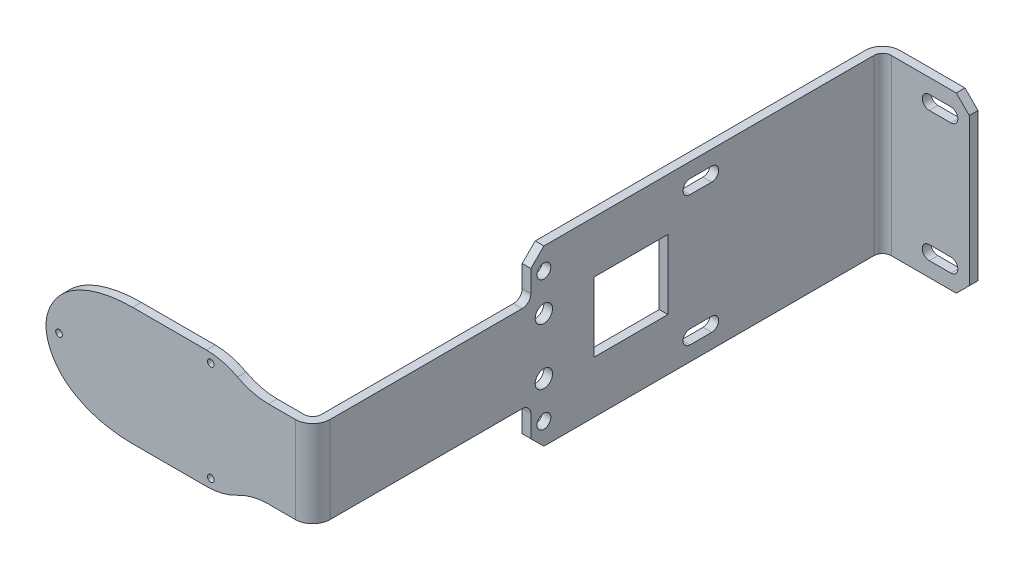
ISO-10303-21;
HEADER;
FILE_DESCRIPTION(('STEP AP214'),'2;1');
FILE_NAME('part.step','',(''),(''),'','','');
FILE_SCHEMA(('AUTOMOTIVE_DESIGN { 1 0 10303 214 1 1 1 1 }'));
ENDSEC;
DATA;
#1=APPLICATION_CONTEXT('core data for automotive mechanical design processes');
#2=APPLICATION_PROTOCOL_DEFINITION('international standard','automotive_design',2000,#1);
#3=PRODUCT_CONTEXT('',#1,'mechanical');
#4=PRODUCT('Part','Part','',(#3));
#5=PRODUCT_RELATED_PRODUCT_CATEGORY('part','',(#4));
#6=PRODUCT_DEFINITION_FORMATION('','',#4);
#7=PRODUCT_DEFINITION_CONTEXT('part definition',#1,'design');
#8=PRODUCT_DEFINITION('design','',#6,#7);
#9=PRODUCT_DEFINITION_SHAPE('','',#8);
#10=(LENGTH_UNIT() NAMED_UNIT(*) SI_UNIT(.MILLI.,.METRE.));
#11=(NAMED_UNIT(*) PLANE_ANGLE_UNIT() SI_UNIT($,.RADIAN.));
#12=(NAMED_UNIT(*) SI_UNIT($,.STERADIAN.) SOLID_ANGLE_UNIT());
#13=UNCERTAINTY_MEASURE_WITH_UNIT(LENGTH_MEASURE(1.E-05),#10,'distance_accuracy_value','');
#14=(GEOMETRIC_REPRESENTATION_CONTEXT(3) GLOBAL_UNCERTAINTY_ASSIGNED_CONTEXT((#13)) GLOBAL_UNIT_ASSIGNED_CONTEXT((#10,
#11,#12)) REPRESENTATION_CONTEXT('',''));
#15=CARTESIAN_POINT('',(0.,0.,0.));
#16=DIRECTION('',(0.,0.,1.));
#17=DIRECTION('',(1.,0.,0.));
#18=AXIS2_PLACEMENT_3D('',#15,#16,#17);
#19=CARTESIAN_POINT('',(-145.525042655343,2.98600867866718,2.));
#20=DIRECTION('',(0.,0.,-1.));
#21=DIRECTION('',(-1.,0.,0.));
#22=AXIS2_PLACEMENT_3D('',#19,#20,#21);
#23=CYLINDRICAL_SURFACE('',#22,15.);
#24=CARTESIAN_POINT('',(-145.525042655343,2.98600867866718,0.));
#25=DIRECTION('',(0.,0.,-1.));
#26=DIRECTION('',(1.,0.,0.));
#27=AXIS2_PLACEMENT_3D('',#24,#25,#26);
#28=CIRCLE('',#27,15.);
#29=CARTESIAN_POINT('',(-152.67275863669,16.1735086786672,0.));
#30=VERTEX_POINT('',#29);
#31=CARTESIAN_POINT('',(-145.525042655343,17.9860086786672,0.));
#32=VERTEX_POINT('',#31);
#33=EDGE_CURVE('E538',#30,#32,#28,.T.);
#34=ORIENTED_EDGE('',*,*,#33,.T.);
#35=DIRECTION('',(0.,0.,-1.));
#36=VECTOR('',#35,1.);
#37=CARTESIAN_POINT('',(-145.525042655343,17.9860086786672,2.));
#38=LINE('',#37,#36);
#39=CARTESIAN_POINT('',(-145.525042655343,17.9860086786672,2.));
#40=VERTEX_POINT('',#39);
#41=EDGE_CURVE('E643',#40,#32,#38,.T.);
#42=ORIENTED_EDGE('',*,*,#41,.F.);
#43=CARTESIAN_POINT('',(-145.525042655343,2.98600867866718,2.));
#44=DIRECTION('',(0.,0.,-1.));
#45=DIRECTION('',(1.,0.,0.));
#46=AXIS2_PLACEMENT_3D('',#43,#44,#45);
#47=CIRCLE('',#46,15.);
#48=CARTESIAN_POINT('',(-152.67275863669,16.1735086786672,2.));
#49=VERTEX_POINT('',#48);
#50=EDGE_CURVE('E570',#49,#40,#47,.T.);
#51=ORIENTED_EDGE('',*,*,#50,.F.);
#52=DIRECTION('',(0.,0.,-1.));
#53=VECTOR('',#52,1.);
#54=CARTESIAN_POINT('',(-152.67275863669,16.1735086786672,2.));
#55=LINE('',#54,#53);
#56=EDGE_CURVE('E951',#49,#30,#55,.T.);
#57=ORIENTED_EDGE('',*,*,#56,.T.);
#58=EDGE_LOOP('',(#34,#42,#51,#57));
#59=FACE_BOUND('',#58,.T.);
#60=ADVANCED_FACE('F22',(#59),#23,.F.);
#61=CARTESIAN_POINT('',(-145.525042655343,17.9860086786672,2.));
#62=DIRECTION('',(0.,1.,0.));
#63=DIRECTION('',(0.,0.,1.));
#64=AXIS2_PLACEMENT_3D('',#61,#62,#63);
#65=PLANE('',#64);
#66=DIRECTION('',(0.,0.,-1.));
#67=VECTOR('',#66,1.);
#68=CARTESIAN_POINT('',(-135.320474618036,17.9860086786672,2.));
#69=LINE('',#68,#67);
#70=CARTESIAN_POINT('',(-135.320474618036,17.9860086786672,-2.));
#71=VERTEX_POINT('',#70);
#72=CARTESIAN_POINT('',(-135.320474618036,17.9860086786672,-46.3));
#73=VERTEX_POINT('',#72);
#74=EDGE_CURVE('E634',#71,#73,#69,.T.);
#75=ORIENTED_EDGE('',*,*,#74,.F.);
#76=CARTESIAN_POINT('',(-139.320474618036,17.9860086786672,-2.));
#77=DIRECTION('',(0.,1.,0.));
#78=DIRECTION('',(0.,0.,1.));
#79=AXIS2_PLACEMENT_3D('',#76,#77,#78);
#80=CIRCLE('',#79,4.);
#81=CARTESIAN_POINT('',(-139.320474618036,17.9860086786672,2.));
#82=VERTEX_POINT('',#81);
#83=EDGE_CURVE('E636',#71,#82,#80,.F.);
#84=ORIENTED_EDGE('',*,*,#83,.T.);
#85=DIRECTION('',(1.,0.,0.));
#86=VECTOR('',#85,1.);
#87=CARTESIAN_POINT('',(-145.525042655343,17.9860086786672,2.));
#88=LINE('',#87,#86);
#89=EDGE_CURVE('E573',#40,#82,#88,.T.);
#90=ORIENTED_EDGE('',*,*,#89,.F.);
#91=ORIENTED_EDGE('',*,*,#41,.T.);
#92=DIRECTION('',(1.,0.,0.));
#93=VECTOR('',#92,1.);
#94=CARTESIAN_POINT('',(-145.525042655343,17.9860086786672,0.));
#95=LINE('',#94,#93);
#96=CARTESIAN_POINT('',(-139.320474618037,17.9860086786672,0.));
#97=VERTEX_POINT('',#96);
#98=EDGE_CURVE('E541',#32,#97,#95,.T.);
#99=ORIENTED_EDGE('',*,*,#98,.T.);
#100=CARTESIAN_POINT('',(-139.320474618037,17.9860086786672,-2.));
#101=DIRECTION('',(0.,1.,0.));
#102=DIRECTION('',(0.,0.,1.));
#103=AXIS2_PLACEMENT_3D('',#100,#101,#102);
#104=CIRCLE('',#103,2.);
#105=CARTESIAN_POINT('',(-137.320474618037,17.9860086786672,-2.));
#106=VERTEX_POINT('',#105);
#107=EDGE_CURVE('E673',#97,#106,#104,.T.);
#108=ORIENTED_EDGE('',*,*,#107,.T.);
#109=DIRECTION('',(0.,0.,1.));
#110=VECTOR('',#109,1.);
#111=CARTESIAN_POINT('',(-137.320474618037,17.9860086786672,2.));
#112=LINE('',#111,#110);
#113=CARTESIAN_POINT('',(-137.320474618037,17.9860086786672,-46.3));
#114=VERTEX_POINT('',#113);
#115=EDGE_CURVE('E517',#114,#106,#112,.T.);
#116=ORIENTED_EDGE('',*,*,#115,.F.);
#117=DIRECTION('',(-1.,0.,0.));
#118=VECTOR('',#117,1.);
#119=CARTESIAN_POINT('',(-145.525042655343,17.9860086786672,-46.3));
#120=LINE('',#119,#118);
#121=EDGE_CURVE('E639',#114,#73,#120,.F.);
#122=ORIENTED_EDGE('',*,*,#121,.T.);
#123=EDGE_LOOP('',(#75,#84,#90,#91,#99,#108,#116,#122));
#124=FACE_BOUND('',#123,.T.);
#125=ADVANCED_FACE('F622',(#124),#65,.F.);
#126=CARTESIAN_POINT('',(-135.320474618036,17.9860086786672,2.));
#127=DIRECTION('',(-1.,0.,0.));
#128=DIRECTION('',(0.,0.,1.));
#129=AXIS2_PLACEMENT_3D('',#126,#127,#128);
#130=PLANE('',#129);
#131=DIRECTION('',(0.,0.,-1.));
#132=VECTOR('',#131,1.);
#133=CARTESIAN_POINT('',(-135.320474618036,41.3860086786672,-85.));
#134=LINE('',#133,#132);
#135=CARTESIAN_POINT('',(-135.320474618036,41.3860086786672,-85.));
#136=VERTEX_POINT('',#135);
#137=CARTESIAN_POINT('',(-135.320474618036,41.3860086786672,-90.));
#138=VERTEX_POINT('',#137);
#139=EDGE_CURVE('E343',#136,#138,#134,.T.);
#140=ORIENTED_EDGE('',*,*,#139,.F.);
#141=CARTESIAN_POINT('',(-135.320474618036,42.9860086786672,-85.));
#142=DIRECTION('',(1.,0.,0.));
#143=DIRECTION('',(0.,0.,-1.));
#144=AXIS2_PLACEMENT_3D('',#141,#142,#143);
#145=CIRCLE('',#144,1.6);
#146=CARTESIAN_POINT('',(-135.320474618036,44.5860086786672,-85.));
#147=VERTEX_POINT('',#146);
#148=EDGE_CURVE('E36',#147,#136,#145,.T.);
#149=ORIENTED_EDGE('',*,*,#148,.F.);
#150=DIRECTION('',(0.,0.,1.));
#151=VECTOR('',#150,1.);
#152=CARTESIAN_POINT('',(-135.320474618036,44.5860086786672,-85.));
#153=LINE('',#152,#151);
#154=CARTESIAN_POINT('',(-135.320474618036,44.5860086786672,-90.));
#155=VERTEX_POINT('',#154);
#156=EDGE_CURVE('E350',#155,#147,#153,.T.);
#157=ORIENTED_EDGE('',*,*,#156,.F.);
#158=CARTESIAN_POINT('',(-135.320474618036,42.9860086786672,-90.));
#159=DIRECTION('',(1.,0.,0.));
#160=DIRECTION('',(0.,0.,-1.));
#161=AXIS2_PLACEMENT_3D('',#158,#159,#160);
#162=CIRCLE('',#161,1.60000000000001);
#163=EDGE_CURVE('E334',#138,#155,#162,.T.);
#164=ORIENTED_EDGE('',*,*,#163,.F.);
#165=EDGE_LOOP('',(#140,#149,#157,#164));
#166=FACE_BOUND('',#165,.T.);
#167=CARTESIAN_POINT('',(-135.320474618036,42.9860086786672,-51.3));
#168=DIRECTION('',(1.,0.,0.));
#169=DIRECTION('',(0.,0.,1.));
#170=AXIS2_PLACEMENT_3D('',#167,#168,#169);
#171=CIRCLE('',#170,1.6);
#172=CARTESIAN_POINT('',(-135.320474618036,42.9860086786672,-49.7));
#173=VERTEX_POINT('',#172);
#174=EDGE_CURVE('E357',#173,#173,#171,.T.);
#175=ORIENTED_EDGE('',*,*,#174,.F.);
#176=EDGE_LOOP('',(#175));
#177=FACE_BOUND('',#176,.T.);
#178=CARTESIAN_POINT('',(-135.320474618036,34.4860086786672,-51.3));
#179=DIRECTION('',(1.,0.,0.));
#180=DIRECTION('',(0.,0.,1.));
#181=AXIS2_PLACEMENT_3D('',#178,#179,#180);
#182=CIRCLE('',#181,2.);
#183=CARTESIAN_POINT('',(-135.320474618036,34.4860086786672,-49.3));
#184=VERTEX_POINT('',#183);
#185=EDGE_CURVE('E363',#184,#184,#182,.T.);
#186=ORIENTED_EDGE('',*,*,#185,.F.);
#187=EDGE_LOOP('',(#186));
#188=FACE_BOUND('',#187,.T.);
#189=CARTESIAN_POINT('',(-135.320474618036,21.4860086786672,-51.3));
#190=DIRECTION('',(1.,0.,0.));
#191=DIRECTION('',(0.,0.,-1.));
#192=AXIS2_PLACEMENT_3D('',#189,#190,#191);
#193=CIRCLE('',#192,2.);
#194=CARTESIAN_POINT('',(-135.320474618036,21.4860086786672,-53.3));
#195=VERTEX_POINT('',#194);
#196=EDGE_CURVE('E367',#195,#195,#193,.T.);
#197=ORIENTED_EDGE('',*,*,#196,.F.);
#198=EDGE_LOOP('',(#197));
#199=FACE_BOUND('',#198,.T.);
#200=CARTESIAN_POINT('',(-135.320474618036,12.9860086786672,-51.3));
#201=DIRECTION('',(1.,0.,0.));
#202=DIRECTION('',(0.,0.,-1.));
#203=AXIS2_PLACEMENT_3D('',#200,#201,#202);
#204=CIRCLE('',#203,1.6);
#205=CARTESIAN_POINT('',(-135.320474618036,12.9860086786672,-52.9));
#206=VERTEX_POINT('',#205);
#207=EDGE_CURVE('E371',#206,#206,#204,.T.);
#208=ORIENTED_EDGE('',*,*,#207,.F.);
#209=EDGE_LOOP('',(#208));
#210=FACE_BOUND('',#209,.T.);
#211=DIRECTION('',(0.,1.,0.));
#212=VECTOR('',#211,1.);
#213=CARTESIAN_POINT('',(-135.320474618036,35.9860086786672,-79.9));
#214=LINE('',#213,#212);
#215=CARTESIAN_POINT('',(-135.320474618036,19.9860086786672,-79.9));
#216=VERTEX_POINT('',#215);
#217=CARTESIAN_POINT('',(-135.320474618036,35.9860086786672,-79.9));
#218=VERTEX_POINT('',#217);
#219=EDGE_CURVE('E377',#216,#218,#214,.T.);
#220=ORIENTED_EDGE('',*,*,#219,.F.);
#221=DIRECTION('',(0.,0.,-1.));
#222=VECTOR('',#221,1.);
#223=CARTESIAN_POINT('',(-135.320474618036,19.9860086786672,-79.9));
#224=LINE('',#223,#222);
#225=CARTESIAN_POINT('',(-135.320474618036,19.9860086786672,-62.9));
#226=VERTEX_POINT('',#225);
#227=EDGE_CURVE('E375',#226,#216,#224,.T.);
#228=ORIENTED_EDGE('',*,*,#227,.F.);
#229=DIRECTION('',(0.,-1.,0.));
#230=VECTOR('',#229,1.);
#231=CARTESIAN_POINT('',(-135.320474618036,19.9860086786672,-62.9));
#232=LINE('',#231,#230);
#233=CARTESIAN_POINT('',(-135.320474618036,35.9860086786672,-62.9));
#234=VERTEX_POINT('',#233);
#235=EDGE_CURVE('E383',#234,#226,#232,.T.);
#236=ORIENTED_EDGE('',*,*,#235,.F.);
#237=DIRECTION('',(0.,0.,1.));
#238=VECTOR('',#237,1.);
#239=CARTESIAN_POINT('',(-135.320474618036,35.9860086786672,-79.9));
#240=LINE('',#239,#238);
#241=EDGE_CURVE('E380',#218,#234,#240,.T.);
#242=ORIENTED_EDGE('',*,*,#241,.F.);
#243=EDGE_LOOP('',(#220,#228,#236,#242));
#244=FACE_BOUND('',#243,.T.);
#245=DIRECTION('',(0.,0.,-1.));
#246=VECTOR('',#245,1.);
#247=CARTESIAN_POINT('',(-135.320474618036,11.3860086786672,-85.));
#248=LINE('',#247,#246);
#249=CARTESIAN_POINT('',(-135.320474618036,11.3860086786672,-85.));
#250=VERTEX_POINT('',#249);
#251=CARTESIAN_POINT('',(-135.320474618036,11.3860086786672,-90.));
#252=VERTEX_POINT('',#251);
#253=EDGE_CURVE('E397',#250,#252,#248,.T.);
#254=ORIENTED_EDGE('',*,*,#253,.F.);
#255=CARTESIAN_POINT('',(-135.320474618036,12.9860086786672,-85.));
#256=DIRECTION('',(1.,0.,0.));
#257=DIRECTION('',(0.,0.,1.));
#258=AXIS2_PLACEMENT_3D('',#255,#256,#257);
#259=CIRCLE('',#258,1.6);
#260=CARTESIAN_POINT('',(-135.320474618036,14.5860086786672,-85.));
#261=VERTEX_POINT('',#260);
#262=EDGE_CURVE('E389',#261,#250,#259,.T.);
#263=ORIENTED_EDGE('',*,*,#262,.F.);
#264=DIRECTION('',(0.,0.,1.));
#265=VECTOR('',#264,1.);
#266=CARTESIAN_POINT('',(-135.320474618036,14.5860086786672,-85.));
#267=LINE('',#266,#265);
#268=CARTESIAN_POINT('',(-135.320474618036,14.5860086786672,-90.));
#269=VERTEX_POINT('',#268);
#270=EDGE_CURVE('E403',#269,#261,#267,.T.);
#271=ORIENTED_EDGE('',*,*,#270,.F.);
#272=CARTESIAN_POINT('',(-135.320474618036,12.9860086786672,-90.));
#273=DIRECTION('',(1.,0.,0.));
#274=DIRECTION('',(0.,0.,1.));
#275=AXIS2_PLACEMENT_3D('',#272,#273,#274);
#276=CIRCLE('',#275,1.6);
#277=EDGE_CURVE('E400',#252,#269,#276,.T.);
#278=ORIENTED_EDGE('',*,*,#277,.F.);
#279=EDGE_LOOP('',(#254,#263,#271,#278));
#280=FACE_BOUND('',#279,.T.);
#281=DIRECTION('',(0.,1.,0.));
#282=VECTOR('',#281,1.);
#283=CARTESIAN_POINT('',(-135.320474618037,17.9860086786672,-48.3));
#284=LINE('',#283,#282);
#285=CARTESIAN_POINT('',(-135.320474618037,10.9860086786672,-48.3));
#286=VERTEX_POINT('',#285);
#287=CARTESIAN_POINT('',(-135.320474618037,15.9860086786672,-48.3));
#288=VERTEX_POINT('',#287);
#289=EDGE_CURVE('E498',#286,#288,#284,.T.);
#290=ORIENTED_EDGE('',*,*,#289,.F.);
#291=DIRECTION('',(0.,0.70710678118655,0.707106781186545));
#292=VECTOR('',#291,1.);
#293=CARTESIAN_POINT('',(-135.320474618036,7.98600867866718,-51.3));
#294=LINE('',#293,#292);
#295=CARTESIAN_POINT('',(-135.320474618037,7.98600867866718,-51.3));
#296=VERTEX_POINT('',#295);
#297=EDGE_CURVE('E690',#286,#296,#294,.F.);
#298=ORIENTED_EDGE('',*,*,#297,.T.);
#299=DIRECTION('',(0.,0.,1.));
#300=VECTOR('',#299,1.);
#301=CARTESIAN_POINT('',(-135.320474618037,7.98600867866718,-131.4));
#302=LINE('',#301,#300);
#303=CARTESIAN_POINT('',(-135.320474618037,7.98600867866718,-127.4));
#304=VERTEX_POINT('',#303);
#305=EDGE_CURVE('E495',#304,#296,#302,.T.);
#306=ORIENTED_EDGE('',*,*,#305,.F.);
#307=DIRECTION('',(0.,1.,0.));
#308=VECTOR('',#307,1.);
#309=CARTESIAN_POINT('',(-135.320474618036,17.9860086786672,-127.4));
#310=LINE('',#309,#308);
#311=CARTESIAN_POINT('',(-135.320474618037,47.9860086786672,-127.4));
#312=VERTEX_POINT('',#311);
#313=EDGE_CURVE('E653',#304,#312,#310,.T.);
#314=ORIENTED_EDGE('',*,*,#313,.T.);
#315=DIRECTION('',(0.,0.,-1.));
#316=VECTOR('',#315,1.);
#317=CARTESIAN_POINT('',(-135.320474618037,47.9860086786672,-48.3));
#318=LINE('',#317,#316);
#319=CARTESIAN_POINT('',(-135.320474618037,47.9860086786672,-51.3));
#320=VERTEX_POINT('',#319);
#321=EDGE_CURVE('E510',#320,#312,#318,.T.);
#322=ORIENTED_EDGE('',*,*,#321,.F.);
#323=DIRECTION('',(0.,0.707106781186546,-0.707106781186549));
#324=VECTOR('',#323,1.);
#325=CARTESIAN_POINT('',(-135.320474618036,44.9860086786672,-48.3));
#326=LINE('',#325,#324);
#327=CARTESIAN_POINT('',(-135.320474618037,44.9860086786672,-48.3));
#328=VERTEX_POINT('',#327);
#329=EDGE_CURVE('E688',#320,#328,#326,.F.);
#330=ORIENTED_EDGE('',*,*,#329,.T.);
#331=DIRECTION('',(0.,1.,0.));
#332=VECTOR('',#331,1.);
#333=CARTESIAN_POINT('',(-135.320474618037,37.9860086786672,-48.3));
#334=LINE('',#333,#332);
#335=CARTESIAN_POINT('',(-135.320474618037,39.9860086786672,-48.3));
#336=VERTEX_POINT('',#335);
#337=EDGE_CURVE('E507',#336,#328,#334,.T.);
#338=ORIENTED_EDGE('',*,*,#337,.F.);
#339=CARTESIAN_POINT('',(-135.320474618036,39.9860086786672,-46.3));
#340=DIRECTION('',(-1.,0.,0.));
#341=DIRECTION('',(0.,0.,1.));
#342=AXIS2_PLACEMENT_3D('',#339,#340,#341);
#343=CIRCLE('',#342,2.);
#344=CARTESIAN_POINT('',(-135.320474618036,37.9860086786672,-46.3));
#345=VERTEX_POINT('',#344);
#346=EDGE_CURVE('E991',#336,#345,#343,.T.);
#347=ORIENTED_EDGE('',*,*,#346,.T.);
#348=DIRECTION('',(0.,0.,-1.));
#349=VECTOR('',#348,1.);
#350=CARTESIAN_POINT('',(-135.320474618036,37.9860086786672,2.));
#351=LINE('',#350,#349);
#352=CARTESIAN_POINT('',(-135.320474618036,37.9860086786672,-2.));
#353=VERTEX_POINT('',#352);
#354=EDGE_CURVE('E644',#353,#345,#351,.T.);
#355=ORIENTED_EDGE('',*,*,#354,.F.);
#356=DIRECTION('',(0.,1.,0.));
#357=VECTOR('',#356,1.);
#358=CARTESIAN_POINT('',(-135.320474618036,17.9860086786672,-2.));
#359=LINE('',#358,#357);
#360=EDGE_CURVE('E650',#353,#71,#359,.F.);
#361=ORIENTED_EDGE('',*,*,#360,.T.);
#362=ORIENTED_EDGE('',*,*,#74,.T.);
#363=CARTESIAN_POINT('',(-135.320474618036,15.9860086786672,-46.3));
#364=DIRECTION('',(-1.,0.,0.));
#365=DIRECTION('',(0.,0.,1.));
#366=AXIS2_PLACEMENT_3D('',#363,#364,#365);
#367=CIRCLE('',#366,2.);
#368=EDGE_CURVE('E996',#73,#288,#367,.T.);
#369=ORIENTED_EDGE('',*,*,#368,.T.);
#370=EDGE_LOOP('',(#290,#298,#306,#314,#322,#330,#338,#347,#355,#361,#362,#369));
#371=FACE_BOUND('',#370,.T.);
#372=ADVANCED_FACE('F347',(#166,#177,#188,#199,#210,#244,#280,#371),#130,.F.);
#373=CARTESIAN_POINT('',(-145.525042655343,37.9860086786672,2.));
#374=DIRECTION('',(0.,-1.,0.));
#375=DIRECTION('',(0.,0.,-1.));
#376=AXIS2_PLACEMENT_3D('',#373,#374,#375);
#377=PLANE('',#376);
#378=DIRECTION('',(-1.,0.,0.));
#379=VECTOR('',#378,1.);
#380=CARTESIAN_POINT('',(-145.525042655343,37.9860086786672,2.));
#381=LINE('',#380,#379);
#382=CARTESIAN_POINT('',(-139.320474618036,37.9860086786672,2.));
#383=VERTEX_POINT('',#382);
#384=CARTESIAN_POINT('',(-145.525042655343,37.9860086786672,2.));
#385=VERTEX_POINT('',#384);
#386=EDGE_CURVE('E576',#383,#385,#381,.T.);
#387=ORIENTED_EDGE('',*,*,#386,.F.);
#388=CARTESIAN_POINT('',(-139.320474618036,37.9860086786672,-2.));
#389=DIRECTION('',(0.,-1.,0.));
#390=DIRECTION('',(0.,0.,-1.));
#391=AXIS2_PLACEMENT_3D('',#388,#389,#390);
#392=CIRCLE('',#391,4.);
#393=EDGE_CURVE('E658',#383,#353,#392,.F.);
#394=ORIENTED_EDGE('',*,*,#393,.T.);
#395=ORIENTED_EDGE('',*,*,#354,.T.);
#396=DIRECTION('',(-1.,0.,0.));
#397=VECTOR('',#396,1.);
#398=CARTESIAN_POINT('',(-145.525042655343,37.9860086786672,-46.3));
#399=LINE('',#398,#397);
#400=CARTESIAN_POINT('',(-137.320474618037,37.9860086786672,-46.3));
#401=VERTEX_POINT('',#400);
#402=EDGE_CURVE('E980',#345,#401,#399,.T.);
#403=ORIENTED_EDGE('',*,*,#402,.T.);
#404=DIRECTION('',(0.,0.,1.));
#405=VECTOR('',#404,1.);
#406=CARTESIAN_POINT('',(-137.320474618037,37.9860086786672,2.));
#407=LINE('',#406,#405);
#408=CARTESIAN_POINT('',(-137.320474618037,37.9860086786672,-2.));
#409=VERTEX_POINT('',#408);
#410=EDGE_CURVE('E514',#401,#409,#407,.T.);
#411=ORIENTED_EDGE('',*,*,#410,.T.);
#412=CARTESIAN_POINT('',(-139.320474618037,37.9860086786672,-2.));
#413=DIRECTION('',(0.,-1.,0.));
#414=DIRECTION('',(0.,0.,-1.));
#415=AXIS2_PLACEMENT_3D('',#412,#413,#414);
#416=CIRCLE('',#415,2.);
#417=CARTESIAN_POINT('',(-139.320474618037,37.9860086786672,0.));
#418=VERTEX_POINT('',#417);
#419=EDGE_CURVE('E675',#409,#418,#416,.T.);
#420=ORIENTED_EDGE('',*,*,#419,.T.);
#421=DIRECTION('',(-1.,0.,0.));
#422=VECTOR('',#421,1.);
#423=CARTESIAN_POINT('',(-145.525042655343,37.9860086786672,0.));
#424=LINE('',#423,#422);
#425=CARTESIAN_POINT('',(-145.525042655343,37.9860086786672,0.));
#426=VERTEX_POINT('',#425);
#427=EDGE_CURVE('E544',#418,#426,#424,.T.);
#428=ORIENTED_EDGE('',*,*,#427,.T.);
#429=DIRECTION('',(0.,0.,-1.));
#430=VECTOR('',#429,1.);
#431=CARTESIAN_POINT('',(-145.525042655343,37.9860086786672,2.));
#432=LINE('',#431,#430);
#433=EDGE_CURVE('E975',#385,#426,#432,.T.);
#434=ORIENTED_EDGE('',*,*,#433,.F.);
#435=EDGE_LOOP('',(#387,#394,#395,#403,#411,#420,#428,#434));
#436=FACE_BOUND('',#435,.T.);
#437=ADVANCED_FACE('F616',(#436),#377,.F.);
#438=CARTESIAN_POINT('',(-145.525042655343,52.9860086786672,2.));
#439=DIRECTION('',(0.,0.,-1.));
#440=DIRECTION('',(-1.,0.,0.));
#441=AXIS2_PLACEMENT_3D('',#438,#439,#440);
#442=CYLINDRICAL_SURFACE('',#441,15.);
#443=CARTESIAN_POINT('',(-145.525042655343,52.9860086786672,0.));
#444=DIRECTION('',(0.,0.,-1.));
#445=DIRECTION('',(-1.,0.,0.));
#446=AXIS2_PLACEMENT_3D('',#443,#444,#445);
#447=CIRCLE('',#446,15.);
#448=CARTESIAN_POINT('',(-152.67275863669,39.7985086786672,0.));
#449=VERTEX_POINT('',#448);
#450=EDGE_CURVE('E546',#426,#449,#447,.T.);
#451=ORIENTED_EDGE('',*,*,#450,.T.);
#452=DIRECTION('',(0.,0.,-1.));
#453=VECTOR('',#452,1.);
#454=CARTESIAN_POINT('',(-152.67275863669,39.7985086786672,2.));
#455=LINE('',#454,#453);
#456=CARTESIAN_POINT('',(-152.67275863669,39.7985086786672,2.));
#457=VERTEX_POINT('',#456);
#458=EDGE_CURVE('E972',#457,#449,#455,.T.);
#459=ORIENTED_EDGE('',*,*,#458,.F.);
#460=CARTESIAN_POINT('',(-145.525042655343,52.9860086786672,2.));
#461=DIRECTION('',(0.,0.,-1.));
#462=DIRECTION('',(-1.,0.,0.));
#463=AXIS2_PLACEMENT_3D('',#460,#461,#462);
#464=CIRCLE('',#463,15.);
#465=EDGE_CURVE('E578',#385,#457,#464,.T.);
#466=ORIENTED_EDGE('',*,*,#465,.F.);
#467=ORIENTED_EDGE('',*,*,#433,.T.);
#468=EDGE_LOOP('',(#451,#459,#466,#467));
#469=FACE_BOUND('',#468,.T.);
#470=ADVANCED_FACE('F612',(#469),#442,.F.);
#471=CARTESIAN_POINT('',(-159.820474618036,26.6110086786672,2.));
#472=DIRECTION('',(0.,0.,-1.));
#473=DIRECTION('',(-1.,0.,0.));
#474=AXIS2_PLACEMENT_3D('',#471,#472,#473);
#475=CYLINDRICAL_SURFACE('',#474,15.);
#476=CARTESIAN_POINT('',(-159.820474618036,26.6110086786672,0.));
#477=DIRECTION('',(0.,0.,1.));
#478=DIRECTION('',(1.,0.,0.));
#479=AXIS2_PLACEMENT_3D('',#476,#477,#478);
#480=CIRCLE('',#479,15.);
#481=CARTESIAN_POINT('',(-159.820474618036,41.6110086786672,0.));
#482=VERTEX_POINT('',#481);
#483=EDGE_CURVE('E548',#449,#482,#480,.T.);
#484=ORIENTED_EDGE('',*,*,#483,.T.);
#485=DIRECTION('',(0.,0.,-1.));
#486=VECTOR('',#485,1.);
#487=CARTESIAN_POINT('',(-159.820474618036,41.6110086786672,2.));
#488=LINE('',#487,#486);
#489=CARTESIAN_POINT('',(-159.820474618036,41.6110086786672,2.));
#490=VERTEX_POINT('',#489);
#491=EDGE_CURVE('E969',#490,#482,#488,.T.);
#492=ORIENTED_EDGE('',*,*,#491,.F.);
#493=CARTESIAN_POINT('',(-159.820474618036,26.6110086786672,2.));
#494=DIRECTION('',(0.,0.,1.));
#495=DIRECTION('',(1.,0.,0.));
#496=AXIS2_PLACEMENT_3D('',#493,#494,#495);
#497=CIRCLE('',#496,15.);
#498=EDGE_CURVE('E580',#457,#490,#497,.T.);
#499=ORIENTED_EDGE('',*,*,#498,.F.);
#500=ORIENTED_EDGE('',*,*,#458,.T.);
#501=EDGE_LOOP('',(#484,#492,#499,#500));
#502=FACE_BOUND('',#501,.T.);
#503=ADVANCED_FACE('F608',(#502),#475,.T.);
#504=CARTESIAN_POINT('',(-176.820474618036,41.6110086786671,2.));
#505=DIRECTION('',(0.,-1.,0.));
#506=DIRECTION('',(1.,0.,0.));
#507=AXIS2_PLACEMENT_3D('',#504,#505,#506);
#508=PLANE('',#507);
#509=DIRECTION('',(-1.,0.,0.));
#510=VECTOR('',#509,1.);
#511=CARTESIAN_POINT('',(-176.820474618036,41.6110086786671,0.));
#512=LINE('',#511,#510);
#513=CARTESIAN_POINT('',(-176.820474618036,41.6110086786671,0.));
#514=VERTEX_POINT('',#513);
#515=EDGE_CURVE('E550',#482,#514,#512,.T.);
#516=ORIENTED_EDGE('',*,*,#515,.T.);
#517=DIRECTION('',(0.,0.,-1.));
#518=VECTOR('',#517,1.);
#519=CARTESIAN_POINT('',(-176.820474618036,41.6110086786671,2.));
#520=LINE('',#519,#518);
#521=CARTESIAN_POINT('',(-176.820474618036,41.6110086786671,2.));
#522=VERTEX_POINT('',#521);
#523=EDGE_CURVE('E966',#522,#514,#520,.T.);
#524=ORIENTED_EDGE('',*,*,#523,.F.);
#525=DIRECTION('',(-1.,0.,0.));
#526=VECTOR('',#525,1.);
#527=CARTESIAN_POINT('',(-176.820474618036,41.6110086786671,2.));
#528=LINE('',#527,#526);
#529=EDGE_CURVE('E582',#490,#522,#528,.T.);
#530=ORIENTED_EDGE('',*,*,#529,.F.);
#531=ORIENTED_EDGE('',*,*,#491,.T.);
#532=EDGE_LOOP('',(#516,#524,#530,#531));
#533=FACE_BOUND('',#532,.T.);
#534=ADVANCED_FACE('F603',(#533),#508,.F.);
#535=CARTESIAN_POINT('',(-176.820474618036,41.6110086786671,2.));
#536=CARTESIAN_POINT('',(-183.107338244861,41.6110086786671,2.));
#537=CARTESIAN_POINT('',(-193.279232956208,39.1141602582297,2.));
#538=CARTESIAN_POINT('',(-196.820474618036,30.3702073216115,2.));
#539=CARTESIAN_POINT('',(-196.820474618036,27.9860086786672,2.));
#540=B_SPLINE_CURVE_WITH_KNOTS('',3,(#535,#536,#537,#538,#539),.UNSPECIFIED.,.F.,.F.,(4,1,4),
(0.,0.725039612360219,1.),.UNSPECIFIED.);
#541=DIRECTION('',(0.,0.,-1.));
#542=VECTOR('',#541,1.);
#543=SURFACE_OF_LINEAR_EXTRUSION('',#540,#542);
#544=CARTESIAN_POINT('',(-176.820474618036,41.6110086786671,0.));
#545=CARTESIAN_POINT('',(-183.107338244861,41.6110086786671,0.));
#546=CARTESIAN_POINT('',(-193.279232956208,39.1141602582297,0.));
#547=CARTESIAN_POINT('',(-196.820474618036,30.3702073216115,0.));
#548=CARTESIAN_POINT('',(-196.820474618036,27.9860086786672,0.));
#549=B_SPLINE_CURVE_WITH_KNOTS('',3,(#544,#545,#546,#547,#548),.UNSPECIFIED.,.F.,.F.,(4,1,4),
(0.,0.725039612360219,1.),.UNSPECIFIED.);
#550=CARTESIAN_POINT('',(-196.820474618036,27.9860086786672,0.));
#551=VERTEX_POINT('',#550);
#552=EDGE_CURVE('E552',#514,#551,#549,.T.);
#553=ORIENTED_EDGE('',*,*,#552,.T.);
#554=DIRECTION('',(0.,0.,-1.));
#555=VECTOR('',#554,1.);
#556=CARTESIAN_POINT('',(-196.820474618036,27.9860086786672,2.));
#557=LINE('',#556,#555);
#558=CARTESIAN_POINT('',(-196.820474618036,27.9860086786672,2.));
#559=VERTEX_POINT('',#558);
#560=EDGE_CURVE('E963',#559,#551,#557,.T.);
#561=ORIENTED_EDGE('',*,*,#560,.F.);
#562=EDGE_CURVE('E584',#522,#559,#540,.T.);
#563=ORIENTED_EDGE('',*,*,#562,.F.);
#564=ORIENTED_EDGE('',*,*,#523,.T.);
#565=EDGE_LOOP('',(#553,#561,#563,#564));
#566=FACE_BOUND('',#565,.T.);
#567=ADVANCED_FACE('F598',(#566),#543,.F.);
#568=CARTESIAN_POINT('',(-196.820474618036,27.9860086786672,2.));
#569=CARTESIAN_POINT('',(-196.820474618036,25.6018100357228,2.));
#570=CARTESIAN_POINT('',(-193.279232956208,16.8578570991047,2.));
#571=CARTESIAN_POINT('',(-183.107338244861,14.3610086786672,2.));
#572=CARTESIAN_POINT('',(-176.820474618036,14.3610086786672,2.));
#573=B_SPLINE_CURVE_WITH_KNOTS('',3,(#568,#569,#570,#571,#572),.UNSPECIFIED.,.F.,.F.,(4,1,4),
(0.,0.274960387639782,1.),.UNSPECIFIED.);
#574=DIRECTION('',(0.,0.,-1.));
#575=VECTOR('',#574,1.);
#576=SURFACE_OF_LINEAR_EXTRUSION('',#573,#575);
#577=CARTESIAN_POINT('',(-196.820474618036,27.9860086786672,0.));
#578=CARTESIAN_POINT('',(-196.820474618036,25.6018100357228,0.));
#579=CARTESIAN_POINT('',(-193.279232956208,16.8578570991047,0.));
#580=CARTESIAN_POINT('',(-183.107338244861,14.3610086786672,0.));
#581=CARTESIAN_POINT('',(-176.820474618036,14.3610086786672,0.));
#582=B_SPLINE_CURVE_WITH_KNOTS('',3,(#577,#578,#579,#580,#581),.UNSPECIFIED.,.F.,.F.,(4,1,4),
(0.,0.274960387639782,1.),.UNSPECIFIED.);
#583=CARTESIAN_POINT('',(-176.820474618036,14.3610086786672,0.));
#584=VERTEX_POINT('',#583);
#585=EDGE_CURVE('E556',#551,#584,#582,.T.);
#586=ORIENTED_EDGE('',*,*,#585,.T.);
#587=DIRECTION('',(0.,0.,-1.));
#588=VECTOR('',#587,1.);
#589=CARTESIAN_POINT('',(-176.820474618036,14.3610086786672,2.));
#590=LINE('',#589,#588);
#591=CARTESIAN_POINT('',(-176.820474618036,14.3610086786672,2.));
#592=VERTEX_POINT('',#591);
#593=EDGE_CURVE('E944',#592,#584,#590,.T.);
#594=ORIENTED_EDGE('',*,*,#593,.F.);
#595=EDGE_CURVE('E589',#559,#592,#573,.T.);
#596=ORIENTED_EDGE('',*,*,#595,.F.);
#597=ORIENTED_EDGE('',*,*,#560,.T.);
#598=EDGE_LOOP('',(#586,#594,#596,#597));
#599=FACE_BOUND('',#598,.T.);
#600=ADVANCED_FACE('F602',(#599),#576,.F.);
#601=CARTESIAN_POINT('',(-176.820474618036,14.3610086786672,2.));
#602=DIRECTION('',(0.,1.,0.));
#603=DIRECTION('',(-1.,0.,0.));
#604=AXIS2_PLACEMENT_3D('',#601,#602,#603);
#605=PLANE('',#604);
#606=DIRECTION('',(1.,0.,0.));
#607=VECTOR('',#606,1.);
#608=CARTESIAN_POINT('',(-176.820474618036,14.3610086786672,0.));
#609=LINE('',#608,#607);
#610=CARTESIAN_POINT('',(-159.820474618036,14.3610086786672,0.));
#611=VERTEX_POINT('',#610);
#612=EDGE_CURVE('E563',#584,#611,#609,.T.);
#613=ORIENTED_EDGE('',*,*,#612,.T.);
#614=DIRECTION('',(0.,0.,-1.));
#615=VECTOR('',#614,1.);
#616=CARTESIAN_POINT('',(-159.820474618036,14.3610086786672,2.));
#617=LINE('',#616,#615);
#618=CARTESIAN_POINT('',(-159.820474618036,14.3610086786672,2.));
#619=VERTEX_POINT('',#618);
#620=EDGE_CURVE('E941',#619,#611,#617,.T.);
#621=ORIENTED_EDGE('',*,*,#620,.F.);
#622=DIRECTION('',(1.,0.,0.));
#623=VECTOR('',#622,1.);
#624=CARTESIAN_POINT('',(-176.820474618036,14.3610086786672,2.));
#625=LINE('',#624,#623);
#626=EDGE_CURVE('E959',#592,#619,#625,.T.);
#627=ORIENTED_EDGE('',*,*,#626,.F.);
#628=ORIENTED_EDGE('',*,*,#593,.T.);
#629=EDGE_LOOP('',(#613,#621,#627,#628));
#630=FACE_BOUND('',#629,.T.);
#631=ADVANCED_FACE('F928',(#630),#605,.F.);
#632=CARTESIAN_POINT('',(-159.820474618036,29.3610086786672,2.));
#633=DIRECTION('',(0.,0.,-1.));
#634=DIRECTION('',(-1.,0.,0.));
#635=AXIS2_PLACEMENT_3D('',#632,#633,#634);
#636=CYLINDRICAL_SURFACE('',#635,15.);
#637=CARTESIAN_POINT('',(-159.820474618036,29.3610086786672,0.));
#638=DIRECTION('',(0.,0.,1.));
#639=DIRECTION('',(-1.,0.,0.));
#640=AXIS2_PLACEMENT_3D('',#637,#638,#639);
#641=CIRCLE('',#640,15.);
#642=EDGE_CURVE('E568',#611,#30,#641,.T.);
#643=ORIENTED_EDGE('',*,*,#642,.T.);
#644=ORIENTED_EDGE('',*,*,#56,.F.);
#645=CARTESIAN_POINT('',(-159.820474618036,29.3610086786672,2.));
#646=DIRECTION('',(0.,0.,1.));
#647=DIRECTION('',(-1.,0.,0.));
#648=AXIS2_PLACEMENT_3D('',#645,#646,#647);
#649=CIRCLE('',#648,15.);
#650=EDGE_CURVE('E950',#619,#49,#649,.T.);
#651=ORIENTED_EDGE('',*,*,#650,.F.);
#652=ORIENTED_EDGE('',*,*,#620,.T.);
#653=EDGE_LOOP('',(#643,#644,#651,#652));
#654=FACE_BOUND('',#653,.T.);
#655=ADVANCED_FACE('F925',(#654),#636,.T.);
#656=CARTESIAN_POINT('',(-145.525042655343,2.98600867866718,2.));
#657=DIRECTION('',(0.,0.,1.));
#658=DIRECTION('',(1.,0.,0.));
#659=AXIS2_PLACEMENT_3D('',#656,#657,#658);
#660=PLANE('',#659);
#661=ORIENTED_EDGE('',*,*,#89,.T.);
#662=DIRECTION('',(0.,1.,0.));
#663=VECTOR('',#662,1.);
#664=CARTESIAN_POINT('',(-139.320474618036,37.9860086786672,2.));
#665=LINE('',#664,#663);
#666=EDGE_CURVE('E652',#82,#383,#665,.T.);
#667=ORIENTED_EDGE('',*,*,#666,.T.);
#668=ORIENTED_EDGE('',*,*,#386,.T.);
#669=ORIENTED_EDGE('',*,*,#465,.T.);
#670=ORIENTED_EDGE('',*,*,#498,.T.);
#671=ORIENTED_EDGE('',*,*,#529,.T.);
#672=ORIENTED_EDGE('',*,*,#562,.T.);
#673=ORIENTED_EDGE('',*,*,#595,.T.);
#674=ORIENTED_EDGE('',*,*,#626,.T.);
#675=ORIENTED_EDGE('',*,*,#650,.T.);
#676=ORIENTED_EDGE('',*,*,#50,.T.);
#677=EDGE_LOOP('',(#661,#667,#668,#669,#670,#671,#672,#673,#674,#675,#676));
#678=FACE_BOUND('',#677,.T.);
#679=CARTESIAN_POINT('',(-158.820474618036,16.4860086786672,2.));
#680=DIRECTION('',(0.,0.,1.));
#681=DIRECTION('',(1.,0.,0.));
#682=AXIS2_PLACEMENT_3D('',#679,#680,#681);
#683=CIRCLE('',#682,0.774999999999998);
#684=CARTESIAN_POINT('',(-158.045474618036,16.4860086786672,2.));
#685=VERTEX_POINT('',#684);
#686=EDGE_CURVE('E523',#685,#685,#683,.T.);
#687=ORIENTED_EDGE('',*,*,#686,.F.);
#688=EDGE_LOOP('',(#687));
#689=FACE_BOUND('',#688,.T.);
#690=CARTESIAN_POINT('',(-158.820474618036,39.4860086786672,2.));
#691=DIRECTION('',(0.,0.,1.));
#692=DIRECTION('',(1.,0.,0.));
#693=AXIS2_PLACEMENT_3D('',#690,#691,#692);
#694=CIRCLE('',#693,0.774999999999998);
#695=CARTESIAN_POINT('',(-158.045474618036,39.4860086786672,2.));
#696=VERTEX_POINT('',#695);
#697=EDGE_CURVE('E529',#696,#696,#694,.T.);
#698=ORIENTED_EDGE('',*,*,#697,.F.);
#699=EDGE_LOOP('',(#698));
#700=FACE_BOUND('',#699,.T.);
#701=CARTESIAN_POINT('',(-193.820474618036,27.9860086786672,2.));
#702=DIRECTION('',(0.,0.,1.));
#703=DIRECTION('',(1.,0.,0.));
#704=AXIS2_PLACEMENT_3D('',#701,#702,#703);
#705=CIRCLE('',#704,0.774999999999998);
#706=CARTESIAN_POINT('',(-193.045474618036,27.9860086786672,2.));
#707=VERTEX_POINT('',#706);
#708=EDGE_CURVE('E535',#707,#707,#705,.T.);
#709=ORIENTED_EDGE('',*,*,#708,.F.);
#710=EDGE_LOOP('',(#709));
#711=FACE_BOUND('',#710,.T.);
#712=ADVANCED_FACE('F921',(#678,#689,#700,#711),#660,.T.);
#713=CARTESIAN_POINT('',(-145.525042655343,2.98600867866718,0.));
#714=DIRECTION('',(0.,0.,1.));
#715=DIRECTION('',(1.,0.,0.));
#716=AXIS2_PLACEMENT_3D('',#713,#714,#715);
#717=PLANE('',#716);
#718=CARTESIAN_POINT('',(-158.820474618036,16.4860086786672,0.));
#719=DIRECTION('',(0.,0.,-1.));
#720=DIRECTION('',(-1.,0.,0.));
#721=AXIS2_PLACEMENT_3D('',#718,#719,#720);
#722=CIRCLE('',#721,0.774999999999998);
#723=CARTESIAN_POINT('',(-159.595474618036,16.4860086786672,0.));
#724=VERTEX_POINT('',#723);
#725=EDGE_CURVE('E520',#724,#724,#722,.T.);
#726=ORIENTED_EDGE('',*,*,#725,.F.);
#727=EDGE_LOOP('',(#726));
#728=FACE_BOUND('',#727,.T.);
#729=CARTESIAN_POINT('',(-158.820474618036,39.4860086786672,0.));
#730=DIRECTION('',(0.,0.,-1.));
#731=DIRECTION('',(-1.,0.,0.));
#732=AXIS2_PLACEMENT_3D('',#729,#730,#731);
#733=CIRCLE('',#732,0.774999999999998);
#734=CARTESIAN_POINT('',(-159.595474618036,39.4860086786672,0.));
#735=VERTEX_POINT('',#734);
#736=EDGE_CURVE('E526',#735,#735,#733,.T.);
#737=ORIENTED_EDGE('',*,*,#736,.F.);
#738=EDGE_LOOP('',(#737));
#739=FACE_BOUND('',#738,.T.);
#740=CARTESIAN_POINT('',(-193.820474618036,27.9860086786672,0.));
#741=DIRECTION('',(0.,0.,-1.));
#742=DIRECTION('',(-1.,0.,0.));
#743=AXIS2_PLACEMENT_3D('',#740,#741,#742);
#744=CIRCLE('',#743,0.774999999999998);
#745=CARTESIAN_POINT('',(-194.595474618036,27.9860086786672,0.));
#746=VERTEX_POINT('',#745);
#747=EDGE_CURVE('E532',#746,#746,#744,.T.);
#748=ORIENTED_EDGE('',*,*,#747,.F.);
#749=EDGE_LOOP('',(#748));
#750=FACE_BOUND('',#749,.T.);
#751=ORIENTED_EDGE('',*,*,#427,.F.);
#752=DIRECTION('',(0.,-1.,0.));
#753=VECTOR('',#752,1.);
#754=CARTESIAN_POINT('',(-139.320474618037,2.98600867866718,0.));
#755=LINE('',#754,#753);
#756=EDGE_CURVE('E664',#418,#97,#755,.T.);
#757=ORIENTED_EDGE('',*,*,#756,.T.);
#758=ORIENTED_EDGE('',*,*,#98,.F.);
#759=ORIENTED_EDGE('',*,*,#33,.F.);
#760=ORIENTED_EDGE('',*,*,#642,.F.);
#761=ORIENTED_EDGE('',*,*,#612,.F.);
#762=ORIENTED_EDGE('',*,*,#585,.F.);
#763=ORIENTED_EDGE('',*,*,#552,.F.);
#764=ORIENTED_EDGE('',*,*,#515,.F.);
#765=ORIENTED_EDGE('',*,*,#483,.F.);
#766=ORIENTED_EDGE('',*,*,#450,.F.);
#767=EDGE_LOOP('',(#751,#757,#758,#759,#760,#761,#762,#763,#764,#765,#766));
#768=FACE_BOUND('',#767,.T.);
#769=ADVANCED_FACE('F917',(#728,#739,#750,#768),#717,.F.);
#770=CARTESIAN_POINT('',(-193.820474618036,27.9860086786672,0.));
#771=DIRECTION('',(0.,0.,-1.));
#772=DIRECTION('',(-1.,0.,0.));
#773=AXIS2_PLACEMENT_3D('',#770,#771,#772);
#774=CYLINDRICAL_SURFACE('',#773,0.774999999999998);
#775=ORIENTED_EDGE('',*,*,#708,.T.);
#776=EDGE_LOOP('',(#775));
#777=FACE_BOUND('',#776,.T.);
#778=ORIENTED_EDGE('',*,*,#747,.T.);
#779=EDGE_LOOP('',(#778));
#780=FACE_BOUND('',#779,.T.);
#781=ADVANCED_FACE('F913',(#777,#780),#774,.F.);
#782=CARTESIAN_POINT('',(-158.820474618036,39.4860086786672,0.));
#783=DIRECTION('',(0.,0.,-1.));
#784=DIRECTION('',(-1.,0.,0.));
#785=AXIS2_PLACEMENT_3D('',#782,#783,#784);
#786=CYLINDRICAL_SURFACE('',#785,0.774999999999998);
#787=ORIENTED_EDGE('',*,*,#697,.T.);
#788=EDGE_LOOP('',(#787));
#789=FACE_BOUND('',#788,.T.);
#790=ORIENTED_EDGE('',*,*,#736,.T.);
#791=EDGE_LOOP('',(#790));
#792=FACE_BOUND('',#791,.T.);
#793=ADVANCED_FACE('F909',(#789,#792),#786,.F.);
#794=CARTESIAN_POINT('',(-158.820474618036,16.4860086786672,0.));
#795=DIRECTION('',(0.,0.,-1.));
#796=DIRECTION('',(-1.,0.,0.));
#797=AXIS2_PLACEMENT_3D('',#794,#795,#796);
#798=CYLINDRICAL_SURFACE('',#797,0.774999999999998);
#799=ORIENTED_EDGE('',*,*,#686,.T.);
#800=EDGE_LOOP('',(#799));
#801=FACE_BOUND('',#800,.T.);
#802=ORIENTED_EDGE('',*,*,#725,.T.);
#803=EDGE_LOOP('',(#802));
#804=FACE_BOUND('',#803,.T.);
#805=ADVANCED_FACE('F904',(#801,#804),#798,.F.);
#806=CARTESIAN_POINT('',(-137.320474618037,17.9860086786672,2.));
#807=DIRECTION('',(-1.,0.,0.));
#808=DIRECTION('',(0.,0.,1.));
#809=AXIS2_PLACEMENT_3D('',#806,#807,#808);
#810=PLANE('',#809);
#811=CARTESIAN_POINT('',(-137.320474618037,42.9860086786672,-85.));
#812=DIRECTION('',(-1.,0.,0.));
#813=DIRECTION('',(0.,0.,1.));
#814=AXIS2_PLACEMENT_3D('',#811,#812,#813);
#815=CIRCLE('',#814,1.6);
#816=CARTESIAN_POINT('',(-137.320474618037,41.3860086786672,-85.));
#817=VERTEX_POINT('',#816);
#818=CARTESIAN_POINT('',(-137.320474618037,44.5860086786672,-85.));
#819=VERTEX_POINT('',#818);
#820=EDGE_CURVE('E11',#817,#819,#815,.T.);
#821=ORIENTED_EDGE('',*,*,#820,.F.);
#822=DIRECTION('',(0.,0.,1.));
#823=VECTOR('',#822,1.);
#824=CARTESIAN_POINT('',(-137.320474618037,41.3860086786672,2.));
#825=LINE('',#824,#823);
#826=CARTESIAN_POINT('',(-137.320474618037,41.3860086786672,-90.));
#827=VERTEX_POINT('',#826);
#828=EDGE_CURVE('E731',#827,#817,#825,.T.);
#829=ORIENTED_EDGE('',*,*,#828,.F.);
#830=CARTESIAN_POINT('',(-137.320474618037,42.9860086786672,-90.));
#831=DIRECTION('',(-1.,0.,0.));
#832=DIRECTION('',(0.,0.,1.));
#833=AXIS2_PLACEMENT_3D('',#830,#831,#832);
#834=CIRCLE('',#833,1.60000000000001);
#835=CARTESIAN_POINT('',(-137.320474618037,44.5860086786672,-90.));
#836=VERTEX_POINT('',#835);
#837=EDGE_CURVE('E337',#836,#827,#834,.T.);
#838=ORIENTED_EDGE('',*,*,#837,.F.);
#839=DIRECTION('',(0.,0.,-1.));
#840=VECTOR('',#839,1.);
#841=CARTESIAN_POINT('',(-137.320474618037,44.5860086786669,2.00000000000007));
#842=LINE('',#841,#840);
#843=EDGE_CURVE('E29',#819,#836,#842,.T.);
#844=ORIENTED_EDGE('',*,*,#843,.F.);
#845=EDGE_LOOP('',(#821,#829,#838,#844));
#846=FACE_BOUND('',#845,.T.);
#847=CARTESIAN_POINT('',(-137.320474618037,42.9860086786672,-51.3));
#848=DIRECTION('',(-1.,0.,0.));
#849=DIRECTION('',(0.,0.,1.));
#850=AXIS2_PLACEMENT_3D('',#847,#848,#849);
#851=CIRCLE('',#850,1.6);
#852=CARTESIAN_POINT('',(-137.320474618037,42.9860086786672,-49.7));
#853=VERTEX_POINT('',#852);
#854=EDGE_CURVE('E362',#853,#853,#851,.T.);
#855=ORIENTED_EDGE('',*,*,#854,.F.);
#856=EDGE_LOOP('',(#855));
#857=FACE_BOUND('',#856,.T.);
#858=CARTESIAN_POINT('',(-137.320474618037,34.4860086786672,-51.3));
#859=DIRECTION('',(-1.,0.,0.));
#860=DIRECTION('',(0.,0.,1.));
#861=AXIS2_PLACEMENT_3D('',#858,#859,#860);
#862=CIRCLE('',#861,2.);
#863=CARTESIAN_POINT('',(-137.320474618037,34.4860086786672,-49.3));
#864=VERTEX_POINT('',#863);
#865=EDGE_CURVE('E366',#864,#864,#862,.T.);
#866=ORIENTED_EDGE('',*,*,#865,.F.);
#867=EDGE_LOOP('',(#866));
#868=FACE_BOUND('',#867,.T.);
#869=CARTESIAN_POINT('',(-137.320474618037,21.4860086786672,-51.3));
#870=DIRECTION('',(-1.,0.,0.));
#871=DIRECTION('',(0.,0.,1.));
#872=AXIS2_PLACEMENT_3D('',#869,#870,#871);
#873=CIRCLE('',#872,2.);
#874=CARTESIAN_POINT('',(-137.320474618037,21.4860086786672,-49.3));
#875=VERTEX_POINT('',#874);
#876=EDGE_CURVE('E370',#875,#875,#873,.T.);
#877=ORIENTED_EDGE('',*,*,#876,.F.);
#878=EDGE_LOOP('',(#877));
#879=FACE_BOUND('',#878,.T.);
#880=CARTESIAN_POINT('',(-137.320474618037,12.9860086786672,-51.3));
#881=DIRECTION('',(-1.,0.,0.));
#882=DIRECTION('',(0.,0.,1.));
#883=AXIS2_PLACEMENT_3D('',#880,#881,#882);
#884=CIRCLE('',#883,1.6);
#885=CARTESIAN_POINT('',(-137.320474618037,12.9860086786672,-49.7));
#886=VERTEX_POINT('',#885);
#887=EDGE_CURVE('E374',#886,#886,#884,.T.);
#888=ORIENTED_EDGE('',*,*,#887,.F.);
#889=EDGE_LOOP('',(#888));
#890=FACE_BOUND('',#889,.T.);
#891=DIRECTION('',(0.,0.,1.));
#892=VECTOR('',#891,1.);
#893=CARTESIAN_POINT('',(-137.320474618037,19.9860086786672,2.));
#894=LINE('',#893,#892);
#895=CARTESIAN_POINT('',(-137.320474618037,19.9860086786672,-79.9));
#896=VERTEX_POINT('',#895);
#897=CARTESIAN_POINT('',(-137.320474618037,19.9860086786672,-62.9));
#898=VERTEX_POINT('',#897);
#899=EDGE_CURVE('E729',#896,#898,#894,.T.);
#900=ORIENTED_EDGE('',*,*,#899,.F.);
#901=DIRECTION('',(0.,-1.,0.));
#902=VECTOR('',#901,1.);
#903=CARTESIAN_POINT('',(-137.320474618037,17.9860086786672,-79.9));
#904=LINE('',#903,#902);
#905=CARTESIAN_POINT('',(-137.320474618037,35.9860086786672,-79.9));
#906=VERTEX_POINT('',#905);
#907=EDGE_CURVE('E722',#906,#896,#904,.T.);
#908=ORIENTED_EDGE('',*,*,#907,.F.);
#909=DIRECTION('',(0.,0.,-1.));
#910=VECTOR('',#909,1.);
#911=CARTESIAN_POINT('',(-137.320474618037,35.9860086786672,2.));
#912=LINE('',#911,#910);
#913=CARTESIAN_POINT('',(-137.320474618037,35.9860086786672,-62.9));
#914=VERTEX_POINT('',#913);
#915=EDGE_CURVE('E724',#914,#906,#912,.T.);
#916=ORIENTED_EDGE('',*,*,#915,.F.);
#917=DIRECTION('',(0.,1.,0.));
#918=VECTOR('',#917,1.);
#919=CARTESIAN_POINT('',(-137.320474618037,17.9860086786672,-62.9));
#920=LINE('',#919,#918);
#921=EDGE_CURVE('E727',#898,#914,#920,.T.);
#922=ORIENTED_EDGE('',*,*,#921,.F.);
#923=EDGE_LOOP('',(#900,#908,#916,#922));
#924=FACE_BOUND('',#923,.T.);
#925=CARTESIAN_POINT('',(-137.320474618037,12.9860086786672,-85.));
#926=DIRECTION('',(-1.,0.,0.));
#927=DIRECTION('',(0.,0.,1.));
#928=AXIS2_PLACEMENT_3D('',#925,#926,#927);
#929=CIRCLE('',#928,1.6);
#930=CARTESIAN_POINT('',(-137.320474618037,11.3860086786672,-85.));
#931=VERTEX_POINT('',#930);
#932=CARTESIAN_POINT('',(-137.320474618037,14.5860086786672,-85.));
#933=VERTEX_POINT('',#932);
#934=EDGE_CURVE('E720',#931,#933,#929,.T.);
#935=ORIENTED_EDGE('',*,*,#934,.F.);
#936=DIRECTION('',(0.,0.,1.));
#937=VECTOR('',#936,1.);
#938=CARTESIAN_POINT('',(-137.320474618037,11.3860086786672,2.));
#939=LINE('',#938,#937);
#940=CARTESIAN_POINT('',(-137.320474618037,11.3860086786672,-90.));
#941=VERTEX_POINT('',#940);
#942=EDGE_CURVE('E713',#941,#931,#939,.T.);
#943=ORIENTED_EDGE('',*,*,#942,.F.);
#944=CARTESIAN_POINT('',(-137.320474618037,12.9860086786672,-90.));
#945=DIRECTION('',(-1.,0.,0.));
#946=DIRECTION('',(0.,0.,1.));
#947=AXIS2_PLACEMENT_3D('',#944,#945,#946);
#948=CIRCLE('',#947,1.6);
#949=CARTESIAN_POINT('',(-137.320474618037,14.5860086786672,-90.));
#950=VERTEX_POINT('',#949);
#951=EDGE_CURVE('E715',#950,#941,#948,.T.);
#952=ORIENTED_EDGE('',*,*,#951,.F.);
#953=DIRECTION('',(0.,0.,-1.));
#954=VECTOR('',#953,1.);
#955=CARTESIAN_POINT('',(-137.320474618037,14.5860086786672,2.));
#956=LINE('',#955,#954);
#957=EDGE_CURVE('E718',#933,#950,#956,.T.);
#958=ORIENTED_EDGE('',*,*,#957,.F.);
#959=EDGE_LOOP('',(#935,#943,#952,#958));
#960=FACE_BOUND('',#959,.T.);
#961=DIRECTION('',(0.,0.,1.));
#962=VECTOR('',#961,1.);
#963=CARTESIAN_POINT('',(-137.320474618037,7.98600867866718,-131.4));
#964=LINE('',#963,#962);
#965=CARTESIAN_POINT('',(-137.320474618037,7.98600867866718,-127.4));
#966=VERTEX_POINT('',#965);
#967=CARTESIAN_POINT('',(-137.320474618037,7.98600867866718,-51.3));
#968=VERTEX_POINT('',#967);
#969=EDGE_CURVE('E490',#966,#968,#964,.T.);
#970=ORIENTED_EDGE('',*,*,#969,.T.);
#971=DIRECTION('',(0.,-0.70710678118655,-0.707106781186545));
#972=VECTOR('',#971,1.);
#973=CARTESIAN_POINT('',(-137.320474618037,39.6360086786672,-19.6500000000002));
#974=LINE('',#973,#972);
#975=CARTESIAN_POINT('',(-137.320474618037,10.9860086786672,-48.3));
#976=VERTEX_POINT('',#975);
#977=EDGE_CURVE('E684',#968,#976,#974,.F.);
#978=ORIENTED_EDGE('',*,*,#977,.T.);
#979=DIRECTION('',(0.,1.,0.));
#980=VECTOR('',#979,1.);
#981=CARTESIAN_POINT('',(-137.320474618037,17.9860086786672,-48.3));
#982=LINE('',#981,#980);
#983=CARTESIAN_POINT('',(-137.320474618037,15.9860086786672,-48.3));
#984=VERTEX_POINT('',#983);
#985=EDGE_CURVE('E493',#976,#984,#982,.T.);
#986=ORIENTED_EDGE('',*,*,#985,.T.);
#987=CARTESIAN_POINT('',(-137.320474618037,15.9860086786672,-46.3));
#988=DIRECTION('',(-1.,0.,0.));
#989=DIRECTION('',(0.,0.,1.));
#990=AXIS2_PLACEMENT_3D('',#987,#988,#989);
#991=CIRCLE('',#990,2.);
#992=EDGE_CURVE('E994',#984,#114,#991,.F.);
#993=ORIENTED_EDGE('',*,*,#992,.T.);
#994=ORIENTED_EDGE('',*,*,#115,.T.);
#995=DIRECTION('',(0.,-1.,0.));
#996=VECTOR('',#995,1.);
#997=CARTESIAN_POINT('',(-137.320474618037,17.9860086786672,-2.));
#998=LINE('',#997,#996);
#999=EDGE_CURVE('E667',#106,#409,#998,.F.);
#1000=ORIENTED_EDGE('',*,*,#999,.T.);
#1001=ORIENTED_EDGE('',*,*,#410,.F.);
#1002=CARTESIAN_POINT('',(-137.320474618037,39.9860086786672,-46.3));
#1003=DIRECTION('',(-1.,0.,0.));
#1004=DIRECTION('',(0.,0.,1.));
#1005=AXIS2_PLACEMENT_3D('',#1002,#1003,#1004);
#1006=CIRCLE('',#1005,2.);
#1007=CARTESIAN_POINT('',(-137.320474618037,39.9860086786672,-48.3));
#1008=VERTEX_POINT('',#1007);
#1009=EDGE_CURVE('E989',#401,#1008,#1006,.F.);
#1010=ORIENTED_EDGE('',*,*,#1009,.T.);
#1011=DIRECTION('',(0.,1.,0.));
#1012=VECTOR('',#1011,1.);
#1013=CARTESIAN_POINT('',(-137.320474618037,37.9860086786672,-48.3));
#1014=LINE('',#1013,#1012);
#1015=CARTESIAN_POINT('',(-137.320474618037,44.9860086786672,-48.3));
#1016=VERTEX_POINT('',#1015);
#1017=EDGE_CURVE('E502',#1008,#1016,#1014,.T.);
#1018=ORIENTED_EDGE('',*,*,#1017,.T.);
#1019=DIRECTION('',(0.,-0.707106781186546,0.707106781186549));
#1020=VECTOR('',#1019,1.);
#1021=CARTESIAN_POINT('',(-137.320474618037,6.33600867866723,-9.6499999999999));
#1022=LINE('',#1021,#1020);
#1023=CARTESIAN_POINT('',(-137.320474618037,47.9860086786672,-51.3));
#1024=VERTEX_POINT('',#1023);
#1025=EDGE_CURVE('E682',#1016,#1024,#1022,.F.);
#1026=ORIENTED_EDGE('',*,*,#1025,.T.);
#1027=DIRECTION('',(0.,0.,-1.));
#1028=VECTOR('',#1027,1.);
#1029=CARTESIAN_POINT('',(-137.320474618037,47.9860086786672,-48.3));
#1030=LINE('',#1029,#1028);
#1031=CARTESIAN_POINT('',(-137.320474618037,47.9860086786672,-127.4));
#1032=VERTEX_POINT('',#1031);
#1033=EDGE_CURVE('E505',#1024,#1032,#1030,.T.);
#1034=ORIENTED_EDGE('',*,*,#1033,.T.);
#1035=DIRECTION('',(0.,1.,0.));
#1036=VECTOR('',#1035,1.);
#1037=CARTESIAN_POINT('',(-137.320474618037,17.9860086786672,-127.4));
#1038=LINE('',#1037,#1036);
#1039=EDGE_CURVE('E1004',#1032,#966,#1038,.F.);
#1040=ORIENTED_EDGE('',*,*,#1039,.T.);
#1041=EDGE_LOOP('',(#970,#978,#986,#993,#994,#1000,#1001,#1010,#1018,#1026,#1034,#1040));
#1042=FACE_BOUND('',#1041,.T.);
#1043=ADVANCED_FACE('F747',(#846,#857,#868,#879,#890,#924,#960,#1042),#810,.T.);
#1044=CARTESIAN_POINT('',(-135.320474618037,17.9860086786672,-131.4));
#1045=DIRECTION('',(0.,0.,-1.));
#1046=DIRECTION('',(-1.,0.,0.));
#1047=AXIS2_PLACEMENT_3D('',#1044,#1045,#1046);
#1048=PLANE('',#1047);
#1049=CARTESIAN_POINT('',(-124.570474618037,12.9860086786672,-131.4));
#1050=DIRECTION('',(0.,0.,1.));
#1051=DIRECTION('',(1.,0.,0.));
#1052=AXIS2_PLACEMENT_3D('',#1049,#1050,#1051);
#1053=CIRCLE('',#1052,1.6);
#1054=CARTESIAN_POINT('',(-124.570474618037,14.5860086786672,-131.4));
#1055=VERTEX_POINT('',#1054);
#1056=CARTESIAN_POINT('',(-124.570474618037,11.3860086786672,-131.4));
#1057=VERTEX_POINT('',#1056);
#1058=EDGE_CURVE('E426',#1055,#1057,#1053,.T.);
#1059=ORIENTED_EDGE('',*,*,#1058,.T.);
#1060=DIRECTION('',(1.,0.,0.));
#1061=VECTOR('',#1060,1.);
#1062=CARTESIAN_POINT('',(-124.570474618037,11.3860086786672,-131.4));
#1063=LINE('',#1062,#1061);
#1064=CARTESIAN_POINT('',(-119.570474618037,11.3860086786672,-131.4));
#1065=VERTEX_POINT('',#1064);
#1066=EDGE_CURVE('E429',#1057,#1065,#1063,.T.);
#1067=ORIENTED_EDGE('',*,*,#1066,.T.);
#1068=CARTESIAN_POINT('',(-119.570474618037,12.9860086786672,-131.4));
#1069=DIRECTION('',(0.,0.,1.));
#1070=DIRECTION('',(1.,0.,0.));
#1071=AXIS2_PLACEMENT_3D('',#1068,#1069,#1070);
#1072=CIRCLE('',#1071,1.6);
#1073=CARTESIAN_POINT('',(-119.570474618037,14.5860086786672,-131.4));
#1074=VERTEX_POINT('',#1073);
#1075=EDGE_CURVE('E432',#1065,#1074,#1072,.T.);
#1076=ORIENTED_EDGE('',*,*,#1075,.T.);
#1077=DIRECTION('',(-1.,0.,0.));
#1078=VECTOR('',#1077,1.);
#1079=CARTESIAN_POINT('',(-124.570474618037,14.5860086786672,-131.4));
#1080=LINE('',#1079,#1078);
#1081=EDGE_CURVE('E435',#1074,#1055,#1080,.T.);
#1082=ORIENTED_EDGE('',*,*,#1081,.T.);
#1083=EDGE_LOOP('',(#1059,#1067,#1076,#1082));
#1084=FACE_BOUND('',#1083,.T.);
#1085=CARTESIAN_POINT('',(-124.570474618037,42.9860086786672,-131.4));
#1086=DIRECTION('',(0.,0.,1.));
#1087=DIRECTION('',(-1.,0.,0.));
#1088=AXIS2_PLACEMENT_3D('',#1085,#1086,#1087);
#1089=CIRCLE('',#1088,1.6);
#1090=CARTESIAN_POINT('',(-124.570474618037,44.5860086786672,-131.4));
#1091=VERTEX_POINT('',#1090);
#1092=CARTESIAN_POINT('',(-124.570474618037,41.3860086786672,-131.4));
#1093=VERTEX_POINT('',#1092);
#1094=EDGE_CURVE('E458',#1091,#1093,#1089,.T.);
#1095=ORIENTED_EDGE('',*,*,#1094,.T.);
#1096=DIRECTION('',(1.,0.,0.));
#1097=VECTOR('',#1096,1.);
#1098=CARTESIAN_POINT('',(-124.570474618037,41.3860086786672,-131.4));
#1099=LINE('',#1098,#1097);
#1100=CARTESIAN_POINT('',(-119.570474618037,41.3860086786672,-131.4));
#1101=VERTEX_POINT('',#1100);
#1102=EDGE_CURVE('E461',#1093,#1101,#1099,.T.);
#1103=ORIENTED_EDGE('',*,*,#1102,.T.);
#1104=CARTESIAN_POINT('',(-119.570474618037,42.9860086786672,-131.4));
#1105=DIRECTION('',(0.,0.,1.));
#1106=DIRECTION('',(-1.,0.,0.));
#1107=AXIS2_PLACEMENT_3D('',#1104,#1105,#1106);
#1108=CIRCLE('',#1107,1.6);
#1109=CARTESIAN_POINT('',(-119.570474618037,44.5860086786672,-131.4));
#1110=VERTEX_POINT('',#1109);
#1111=EDGE_CURVE('E464',#1101,#1110,#1108,.T.);
#1112=ORIENTED_EDGE('',*,*,#1111,.T.);
#1113=DIRECTION('',(-1.,0.,0.));
#1114=VECTOR('',#1113,1.);
#1115=CARTESIAN_POINT('',(-124.570474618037,44.5860086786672,-131.4));
#1116=LINE('',#1115,#1114);
#1117=EDGE_CURVE('E467',#1110,#1091,#1116,.T.);
#1118=ORIENTED_EDGE('',*,*,#1117,.T.);
#1119=EDGE_LOOP('',(#1095,#1103,#1112,#1118));
#1120=FACE_BOUND('',#1119,.T.);
#1121=DIRECTION('',(-1.,0.,0.));
#1122=VECTOR('',#1121,1.);
#1123=CARTESIAN_POINT('',(-135.320474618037,47.9860086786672,-131.4));
#1124=LINE('',#1123,#1122);
#1125=CARTESIAN_POINT('',(-118.320474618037,47.9860086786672,-131.4));
#1126=VERTEX_POINT('',#1125);
#1127=CARTESIAN_POINT('',(-133.320474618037,47.9860086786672,-131.4));
#1128=VERTEX_POINT('',#1127);
#1129=EDGE_CURVE('E512',#1126,#1128,#1124,.T.);
#1130=ORIENTED_EDGE('',*,*,#1129,.F.);
#1131=DIRECTION('',(-0.707106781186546,0.707106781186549,0.));
#1132=VECTOR('',#1131,1.);
#1133=CARTESIAN_POINT('',(-111.820474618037,41.4860086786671,-131.4));
#1134=LINE('',#1133,#1132);
#1135=CARTESIAN_POINT('',(-115.320474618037,44.9860086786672,-131.4));
#1136=VERTEX_POINT('',#1135);
#1137=EDGE_CURVE('E702',#1126,#1136,#1134,.F.);
#1138=ORIENTED_EDGE('',*,*,#1137,.T.);
#1139=DIRECTION('',(0.,-1.,0.));
#1140=VECTOR('',#1139,1.);
#1141=CARTESIAN_POINT('',(-115.320474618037,47.9860086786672,-131.4));
#1142=LINE('',#1141,#1140);
#1143=CARTESIAN_POINT('',(-115.320474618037,10.9860086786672,-131.4));
#1144=VERTEX_POINT('',#1143);
#1145=EDGE_CURVE('E473',#1136,#1144,#1142,.T.);
#1146=ORIENTED_EDGE('',*,*,#1145,.T.);
#1147=DIRECTION('',(0.707106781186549,0.707106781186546,0.));
#1148=VECTOR('',#1147,1.);
#1149=CARTESIAN_POINT('',(-121.820474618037,4.48600867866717,-131.4));
#1150=LINE('',#1149,#1148);
#1151=CARTESIAN_POINT('',(-118.320474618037,7.98600867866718,-131.4));
#1152=VERTEX_POINT('',#1151);
#1153=EDGE_CURVE('E700',#1144,#1152,#1150,.F.);
#1154=ORIENTED_EDGE('',*,*,#1153,.T.);
#1155=DIRECTION('',(-1.,0.,0.));
#1156=VECTOR('',#1155,1.);
#1157=CARTESIAN_POINT('',(-135.320474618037,7.98600867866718,-131.4));
#1158=LINE('',#1157,#1156);
#1159=CARTESIAN_POINT('',(-133.320474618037,7.98600867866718,-131.4));
#1160=VERTEX_POINT('',#1159);
#1161=EDGE_CURVE('E500',#1152,#1160,#1158,.T.);
#1162=ORIENTED_EDGE('',*,*,#1161,.T.);
#1163=DIRECTION('',(0.,1.,0.));
#1164=VECTOR('',#1163,1.);
#1165=CARTESIAN_POINT('',(-133.320474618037,17.9860086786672,-131.4));
#1166=LINE('',#1165,#1164);
#1167=EDGE_CURVE('E998',#1160,#1128,#1166,.T.);
#1168=ORIENTED_EDGE('',*,*,#1167,.T.);
#1169=EDGE_LOOP('',(#1130,#1138,#1146,#1154,#1162,#1168));
#1170=FACE_BOUND('',#1169,.T.);
#1171=ADVANCED_FACE('F900',(#1084,#1120,#1170),#1048,.T.);
#1172=CARTESIAN_POINT('',(-135.320474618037,37.9860086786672,-48.3));
#1173=DIRECTION('',(0.,0.,1.));
#1174=DIRECTION('',(1.,0.,0.));
#1175=AXIS2_PLACEMENT_3D('',#1172,#1173,#1174);
#1176=PLANE('',#1175);
#1177=ORIENTED_EDGE('',*,*,#337,.T.);
#1178=DIRECTION('',(-1.,0.,0.));
#1179=VECTOR('',#1178,1.);
#1180=CARTESIAN_POINT('',(-135.320474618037,44.9860086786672,-48.3));
#1181=LINE('',#1180,#1179);
#1182=EDGE_CURVE('E692',#328,#1016,#1181,.T.);
#1183=ORIENTED_EDGE('',*,*,#1182,.T.);
#1184=ORIENTED_EDGE('',*,*,#1017,.F.);
#1185=DIRECTION('',(-1.,0.,0.));
#1186=VECTOR('',#1185,1.);
#1187=CARTESIAN_POINT('',(-135.320474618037,39.9860086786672,-48.3));
#1188=LINE('',#1187,#1186);
#1189=EDGE_CURVE('E983',#1008,#336,#1188,.F.);
#1190=ORIENTED_EDGE('',*,*,#1189,.T.);
#1191=EDGE_LOOP('',(#1177,#1183,#1184,#1190));
#1192=FACE_BOUND('',#1191,.T.);
#1193=ADVANCED_FACE('F896',(#1192),#1176,.T.);
#1194=CARTESIAN_POINT('',(-135.320474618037,47.9860086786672,-48.3));
#1195=DIRECTION('',(0.,1.,0.));
#1196=DIRECTION('',(0.,0.,1.));
#1197=AXIS2_PLACEMENT_3D('',#1194,#1195,#1196);
#1198=PLANE('',#1197);
#1199=ORIENTED_EDGE('',*,*,#1033,.F.);
#1200=DIRECTION('',(1.,0.,0.));
#1201=VECTOR('',#1200,1.);
#1202=CARTESIAN_POINT('',(-135.320474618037,47.9860086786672,-51.3));
#1203=LINE('',#1202,#1201);
#1204=EDGE_CURVE('E698',#1024,#320,#1203,.T.);
#1205=ORIENTED_EDGE('',*,*,#1204,.T.);
#1206=ORIENTED_EDGE('',*,*,#321,.T.);
#1207=CARTESIAN_POINT('',(-133.320474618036,47.9860086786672,-127.4));
#1208=DIRECTION('',(0.,1.,0.));
#1209=DIRECTION('',(0.,0.,1.));
#1210=AXIS2_PLACEMENT_3D('',#1207,#1208,#1209);
#1211=CIRCLE('',#1210,2.);
#1212=CARTESIAN_POINT('',(-133.320474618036,47.9860086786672,-129.4));
#1213=VERTEX_POINT('',#1212);
#1214=EDGE_CURVE('E669',#312,#1213,#1211,.F.);
#1215=ORIENTED_EDGE('',*,*,#1214,.T.);
#1216=DIRECTION('',(1.,0.,0.));
#1217=VECTOR('',#1216,1.);
#1218=CARTESIAN_POINT('',(-137.320474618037,47.9860086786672,-129.4));
#1219=LINE('',#1218,#1217);
#1220=CARTESIAN_POINT('',(-118.320474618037,47.9860086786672,-129.4));
#1221=VERTEX_POINT('',#1220);
#1222=EDGE_CURVE('E482',#1213,#1221,#1219,.T.);
#1223=ORIENTED_EDGE('',*,*,#1222,.T.);
#1224=DIRECTION('',(0.,0.,-1.));
#1225=VECTOR('',#1224,1.);
#1226=CARTESIAN_POINT('',(-118.320474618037,47.9860086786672,-48.3));
#1227=LINE('',#1226,#1225);
#1228=EDGE_CURVE('E695',#1221,#1126,#1227,.T.);
#1229=ORIENTED_EDGE('',*,*,#1228,.T.);
#1230=ORIENTED_EDGE('',*,*,#1129,.T.);
#1231=CARTESIAN_POINT('',(-133.320474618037,47.9860086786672,-127.4));
#1232=DIRECTION('',(0.,1.,0.));
#1233=DIRECTION('',(0.,0.,1.));
#1234=AXIS2_PLACEMENT_3D('',#1231,#1232,#1233);
#1235=CIRCLE('',#1234,4.);
#1236=EDGE_CURVE('E1001',#1128,#1032,#1235,.T.);
#1237=ORIENTED_EDGE('',*,*,#1236,.T.);
#1238=EDGE_LOOP('',(#1199,#1205,#1206,#1215,#1223,#1229,#1230,#1237));
#1239=FACE_BOUND('',#1238,.T.);
#1240=ADVANCED_FACE('F889',(#1239),#1198,.T.);
#1241=CARTESIAN_POINT('',(-135.320474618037,17.9860086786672,-48.3));
#1242=DIRECTION('',(0.,0.,1.));
#1243=DIRECTION('',(1.,0.,0.));
#1244=AXIS2_PLACEMENT_3D('',#1241,#1242,#1243);
#1245=PLANE('',#1244);
#1246=ORIENTED_EDGE('',*,*,#985,.F.);
#1247=DIRECTION('',(1.,0.,0.));
#1248=VECTOR('',#1247,1.);
#1249=CARTESIAN_POINT('',(-135.320474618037,10.9860086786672,-48.3));
#1250=LINE('',#1249,#1248);
#1251=EDGE_CURVE('E686',#976,#286,#1250,.T.);
#1252=ORIENTED_EDGE('',*,*,#1251,.T.);
#1253=ORIENTED_EDGE('',*,*,#289,.T.);
#1254=DIRECTION('',(-1.,0.,0.));
#1255=VECTOR('',#1254,1.);
#1256=CARTESIAN_POINT('',(-135.320474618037,15.9860086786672,-48.3));
#1257=LINE('',#1256,#1255);
#1258=EDGE_CURVE('E985',#288,#984,#1257,.T.);
#1259=ORIENTED_EDGE('',*,*,#1258,.T.);
#1260=EDGE_LOOP('',(#1246,#1252,#1253,#1259));
#1261=FACE_BOUND('',#1260,.T.);
#1262=ADVANCED_FACE('F886',(#1261),#1245,.T.);
#1263=CARTESIAN_POINT('',(-135.320474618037,7.98600867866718,-131.4));
#1264=DIRECTION('',(0.,-1.,0.));
#1265=DIRECTION('',(0.,0.,-1.));
#1266=AXIS2_PLACEMENT_3D('',#1263,#1264,#1265);
#1267=PLANE('',#1266);
#1268=ORIENTED_EDGE('',*,*,#305,.T.);
#1269=DIRECTION('',(-1.,0.,0.));
#1270=VECTOR('',#1269,1.);
#1271=CARTESIAN_POINT('',(-135.320474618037,7.98600867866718,-51.3));
#1272=LINE('',#1271,#1270);
#1273=EDGE_CURVE('E679',#296,#968,#1272,.T.);
#1274=ORIENTED_EDGE('',*,*,#1273,.T.);
#1275=ORIENTED_EDGE('',*,*,#969,.F.);
#1276=CARTESIAN_POINT('',(-133.320474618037,7.98600867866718,-127.4));
#1277=DIRECTION('',(0.,-1.,0.));
#1278=DIRECTION('',(0.,0.,-1.));
#1279=AXIS2_PLACEMENT_3D('',#1276,#1277,#1278);
#1280=CIRCLE('',#1279,4.);
#1281=EDGE_CURVE('E1006',#966,#1160,#1280,.T.);
#1282=ORIENTED_EDGE('',*,*,#1281,.T.);
#1283=ORIENTED_EDGE('',*,*,#1161,.F.);
#1284=DIRECTION('',(0.,0.,1.));
#1285=VECTOR('',#1284,1.);
#1286=CARTESIAN_POINT('',(-118.320474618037,7.98600867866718,-131.4));
#1287=LINE('',#1286,#1285);
#1288=CARTESIAN_POINT('',(-118.320474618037,7.98600867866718,-129.4));
#1289=VERTEX_POINT('',#1288);
#1290=EDGE_CURVE('E677',#1152,#1289,#1287,.T.);
#1291=ORIENTED_EDGE('',*,*,#1290,.T.);
#1292=DIRECTION('',(-1.,0.,0.));
#1293=VECTOR('',#1292,1.);
#1294=CARTESIAN_POINT('',(-137.320474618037,7.98600867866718,-129.4));
#1295=LINE('',#1294,#1293);
#1296=CARTESIAN_POINT('',(-133.320474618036,7.98600867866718,-129.4));
#1297=VERTEX_POINT('',#1296);
#1298=EDGE_CURVE('E488',#1289,#1297,#1295,.T.);
#1299=ORIENTED_EDGE('',*,*,#1298,.T.);
#1300=CARTESIAN_POINT('',(-133.320474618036,7.98600867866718,-127.4));
#1301=DIRECTION('',(0.,-1.,0.));
#1302=DIRECTION('',(0.,0.,-1.));
#1303=AXIS2_PLACEMENT_3D('',#1300,#1301,#1302);
#1304=CIRCLE('',#1303,2.);
#1305=EDGE_CURVE('E671',#1297,#304,#1304,.F.);
#1306=ORIENTED_EDGE('',*,*,#1305,.T.);
#1307=EDGE_LOOP('',(#1268,#1274,#1275,#1282,#1283,#1291,#1299,#1306));
#1308=FACE_BOUND('',#1307,.T.);
#1309=ADVANCED_FACE('F884',(#1308),#1267,.T.);
#1310=CARTESIAN_POINT('',(-145.525042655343,39.9860086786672,-46.3));
#1311=DIRECTION('',(-1.,0.,0.));
#1312=DIRECTION('',(0.,0.,1.));
#1313=AXIS2_PLACEMENT_3D('',#1310,#1311,#1312);
#1314=CYLINDRICAL_SURFACE('',#1313,2.);
#1315=ORIENTED_EDGE('',*,*,#346,.F.);
#1316=ORIENTED_EDGE('',*,*,#1189,.F.);
#1317=ORIENTED_EDGE('',*,*,#1009,.F.);
#1318=ORIENTED_EDGE('',*,*,#402,.F.);
#1319=EDGE_LOOP('',(#1315,#1316,#1317,#1318));
#1320=FACE_BOUND('',#1319,.T.);
#1321=ADVANCED_FACE('F880',(#1320),#1314,.F.);
#1322=CARTESIAN_POINT('',(-135.320474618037,15.9860086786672,-46.3));
#1323=DIRECTION('',(-1.,0.,0.));
#1324=DIRECTION('',(0.,0.,1.));
#1325=AXIS2_PLACEMENT_3D('',#1322,#1323,#1324);
#1326=CYLINDRICAL_SURFACE('',#1325,2.);
#1327=ORIENTED_EDGE('',*,*,#368,.F.);
#1328=ORIENTED_EDGE('',*,*,#121,.F.);
#1329=ORIENTED_EDGE('',*,*,#992,.F.);
#1330=ORIENTED_EDGE('',*,*,#1258,.F.);
#1331=EDGE_LOOP('',(#1327,#1328,#1329,#1330));
#1332=FACE_BOUND('',#1331,.T.);
#1333=ADVANCED_FACE('F873',(#1332),#1326,.F.);
#1334=CARTESIAN_POINT('',(-137.320474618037,7.98600867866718,-129.4));
#1335=DIRECTION('',(0.,0.,1.));
#1336=DIRECTION('',(1.,0.,0.));
#1337=AXIS2_PLACEMENT_3D('',#1334,#1335,#1336);
#1338=PLANE('',#1337);
#1339=CARTESIAN_POINT('',(-124.570474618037,12.9860086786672,-129.4));
#1340=DIRECTION('',(0.,0.,1.));
#1341=DIRECTION('',(1.,0.,0.));
#1342=AXIS2_PLACEMENT_3D('',#1339,#1340,#1341);
#1343=CIRCLE('',#1342,1.6);
#1344=CARTESIAN_POINT('',(-124.570474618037,14.5860086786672,-129.4));
#1345=VERTEX_POINT('',#1344);
#1346=CARTESIAN_POINT('',(-124.570474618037,11.3860086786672,-129.4));
#1347=VERTEX_POINT('',#1346);
#1348=EDGE_CURVE('E409',#1345,#1347,#1343,.T.);
#1349=ORIENTED_EDGE('',*,*,#1348,.F.);
#1350=DIRECTION('',(-1.,0.,0.));
#1351=VECTOR('',#1350,1.);
#1352=CARTESIAN_POINT('',(-124.570474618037,14.5860086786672,-129.4));
#1353=LINE('',#1352,#1351);
#1354=CARTESIAN_POINT('',(-119.570474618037,14.5860086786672,-129.4));
#1355=VERTEX_POINT('',#1354);
#1356=EDGE_CURVE('E423',#1355,#1345,#1353,.T.);
#1357=ORIENTED_EDGE('',*,*,#1356,.F.);
#1358=CARTESIAN_POINT('',(-119.570474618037,12.9860086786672,-129.4));
#1359=DIRECTION('',(0.,0.,1.));
#1360=DIRECTION('',(1.,0.,0.));
#1361=AXIS2_PLACEMENT_3D('',#1358,#1359,#1360);
#1362=CIRCLE('',#1361,1.6);
#1363=CARTESIAN_POINT('',(-119.570474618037,11.3860086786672,-129.4));
#1364=VERTEX_POINT('',#1363);
#1365=EDGE_CURVE('E420',#1364,#1355,#1362,.T.);
#1366=ORIENTED_EDGE('',*,*,#1365,.F.);
#1367=DIRECTION('',(1.,0.,0.));
#1368=VECTOR('',#1367,1.);
#1369=CARTESIAN_POINT('',(-124.570474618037,11.3860086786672,-129.4));
#1370=LINE('',#1369,#1368);
#1371=EDGE_CURVE('E417',#1347,#1364,#1370,.T.);
#1372=ORIENTED_EDGE('',*,*,#1371,.F.);
#1373=EDGE_LOOP('',(#1349,#1357,#1366,#1372));
#1374=FACE_BOUND('',#1373,.T.);
#1375=CARTESIAN_POINT('',(-124.570474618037,42.9860086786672,-129.4));
#1376=DIRECTION('',(0.,0.,1.));
#1377=DIRECTION('',(-1.,0.,0.));
#1378=AXIS2_PLACEMENT_3D('',#1375,#1376,#1377);
#1379=CIRCLE('',#1378,1.6);
#1380=CARTESIAN_POINT('',(-124.570474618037,44.5860086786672,-129.4));
#1381=VERTEX_POINT('',#1380);
#1382=CARTESIAN_POINT('',(-124.570474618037,41.3860086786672,-129.4));
#1383=VERTEX_POINT('',#1382);
#1384=EDGE_CURVE('E441',#1381,#1383,#1379,.T.);
#1385=ORIENTED_EDGE('',*,*,#1384,.F.);
#1386=DIRECTION('',(-1.,0.,0.));
#1387=VECTOR('',#1386,1.);
#1388=CARTESIAN_POINT('',(-124.570474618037,44.5860086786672,-129.4));
#1389=LINE('',#1388,#1387);
#1390=CARTESIAN_POINT('',(-119.570474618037,44.5860086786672,-129.4));
#1391=VERTEX_POINT('',#1390);
#1392=EDGE_CURVE('E455',#1391,#1381,#1389,.T.);
#1393=ORIENTED_EDGE('',*,*,#1392,.F.);
#1394=CARTESIAN_POINT('',(-119.570474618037,42.9860086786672,-129.4));
#1395=DIRECTION('',(0.,0.,1.));
#1396=DIRECTION('',(-1.,0.,0.));
#1397=AXIS2_PLACEMENT_3D('',#1394,#1395,#1396);
#1398=CIRCLE('',#1397,1.6);
#1399=CARTESIAN_POINT('',(-119.570474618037,41.3860086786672,-129.4));
#1400=VERTEX_POINT('',#1399);
#1401=EDGE_CURVE('E452',#1400,#1391,#1398,.T.);
#1402=ORIENTED_EDGE('',*,*,#1401,.F.);
#1403=DIRECTION('',(1.,0.,0.));
#1404=VECTOR('',#1403,1.);
#1405=CARTESIAN_POINT('',(-124.570474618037,41.3860086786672,-129.4));
#1406=LINE('',#1405,#1404);
#1407=EDGE_CURVE('E449',#1383,#1400,#1406,.T.);
#1408=ORIENTED_EDGE('',*,*,#1407,.F.);
#1409=EDGE_LOOP('',(#1385,#1393,#1402,#1408));
#1410=FACE_BOUND('',#1409,.T.);
#1411=DIRECTION('',(0.,-1.,0.));
#1412=VECTOR('',#1411,1.);
#1413=CARTESIAN_POINT('',(-115.320474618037,47.9860086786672,-129.4));
#1414=LINE('',#1413,#1412);
#1415=CARTESIAN_POINT('',(-115.320474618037,44.9860086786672,-129.4));
#1416=VERTEX_POINT('',#1415);
#1417=CARTESIAN_POINT('',(-115.320474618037,10.9860086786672,-129.4));
#1418=VERTEX_POINT('',#1417);
#1419=EDGE_CURVE('E485',#1416,#1418,#1414,.T.);
#1420=ORIENTED_EDGE('',*,*,#1419,.F.);
#1421=DIRECTION('',(0.707106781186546,-0.707106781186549,0.));
#1422=VECTOR('',#1421,1.);
#1423=CARTESIAN_POINT('',(-107.820474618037,37.4860086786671,-129.4));
#1424=LINE('',#1423,#1422);
#1425=EDGE_CURVE('E711',#1416,#1221,#1424,.F.);
#1426=ORIENTED_EDGE('',*,*,#1425,.T.);
#1427=ORIENTED_EDGE('',*,*,#1222,.F.);
#1428=DIRECTION('',(0.,1.,0.));
#1429=VECTOR('',#1428,1.);
#1430=CARTESIAN_POINT('',(-133.320474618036,7.98600867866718,-129.4));
#1431=LINE('',#1430,#1429);
#1432=EDGE_CURVE('E656',#1213,#1297,#1431,.F.);
#1433=ORIENTED_EDGE('',*,*,#1432,.T.);
#1434=ORIENTED_EDGE('',*,*,#1298,.F.);
#1435=DIRECTION('',(-0.707106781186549,-0.707106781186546,0.));
#1436=VECTOR('',#1435,1.);
#1437=CARTESIAN_POINT('',(-127.820474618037,-1.51399132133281,-129.4));
#1438=LINE('',#1437,#1436);
#1439=EDGE_CURVE('E709',#1289,#1418,#1438,.F.);
#1440=ORIENTED_EDGE('',*,*,#1439,.T.);
#1441=EDGE_LOOP('',(#1420,#1426,#1427,#1433,#1434,#1440));
#1442=FACE_BOUND('',#1441,.T.);
#1443=ADVANCED_FACE('F870',(#1374,#1410,#1442),#1338,.T.);
#1444=CARTESIAN_POINT('',(-115.320474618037,47.9860086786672,-129.4));
#1445=DIRECTION('',(1.,0.,0.));
#1446=DIRECTION('',(0.,0.,-1.));
#1447=AXIS2_PLACEMENT_3D('',#1444,#1445,#1446);
#1448=PLANE('',#1447);
#1449=ORIENTED_EDGE('',*,*,#1145,.F.);
#1450=DIRECTION('',(0.,0.,1.));
#1451=VECTOR('',#1450,1.);
#1452=CARTESIAN_POINT('',(-115.320474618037,44.9860086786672,-129.4));
#1453=LINE('',#1452,#1451);
#1454=EDGE_CURVE('E707',#1136,#1416,#1453,.T.);
#1455=ORIENTED_EDGE('',*,*,#1454,.T.);
#1456=ORIENTED_EDGE('',*,*,#1419,.T.);
#1457=DIRECTION('',(0.,0.,-1.));
#1458=VECTOR('',#1457,1.);
#1459=CARTESIAN_POINT('',(-115.320474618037,10.9860086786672,-129.4));
#1460=LINE('',#1459,#1458);
#1461=EDGE_CURVE('E704',#1418,#1144,#1460,.T.);
#1462=ORIENTED_EDGE('',*,*,#1461,.T.);
#1463=EDGE_LOOP('',(#1449,#1455,#1456,#1462));
#1464=FACE_BOUND('',#1463,.T.);
#1465=ADVANCED_FACE('F868',(#1464),#1448,.T.);
#1466=CARTESIAN_POINT('',(-133.320474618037,17.9860086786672,-127.4));
#1467=DIRECTION('',(0.,1.,0.));
#1468=DIRECTION('',(0.,0.,1.));
#1469=AXIS2_PLACEMENT_3D('',#1466,#1467,#1468);
#1470=CYLINDRICAL_SURFACE('',#1469,4.);
#1471=ORIENTED_EDGE('',*,*,#1281,.F.);
#1472=ORIENTED_EDGE('',*,*,#1039,.F.);
#1473=ORIENTED_EDGE('',*,*,#1236,.F.);
#1474=ORIENTED_EDGE('',*,*,#1167,.F.);
#1475=EDGE_LOOP('',(#1471,#1472,#1473,#1474));
#1476=FACE_BOUND('',#1475,.T.);
#1477=ADVANCED_FACE('F865',(#1476),#1470,.T.);
#1478=CARTESIAN_POINT('',(-139.320474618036,2.98600867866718,-2.));
#1479=DIRECTION('',(0.,-1.,0.));
#1480=DIRECTION('',(0.,0.,-1.));
#1481=AXIS2_PLACEMENT_3D('',#1478,#1479,#1480);
#1482=CYLINDRICAL_SURFACE('',#1481,4.);
#1483=ORIENTED_EDGE('',*,*,#83,.F.);
#1484=ORIENTED_EDGE('',*,*,#360,.F.);
#1485=ORIENTED_EDGE('',*,*,#393,.F.);
#1486=ORIENTED_EDGE('',*,*,#666,.F.);
#1487=EDGE_LOOP('',(#1483,#1484,#1485,#1486));
#1488=FACE_BOUND('',#1487,.T.);
#1489=ADVANCED_FACE('F649',(#1488),#1482,.T.);
#1490=CARTESIAN_POINT('',(-133.320474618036,17.9860086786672,-127.4));
#1491=DIRECTION('',(0.,1.,0.));
#1492=DIRECTION('',(0.,0.,1.));
#1493=AXIS2_PLACEMENT_3D('',#1490,#1491,#1492);
#1494=CYLINDRICAL_SURFACE('',#1493,2.);
#1495=ORIENTED_EDGE('',*,*,#1305,.F.);
#1496=ORIENTED_EDGE('',*,*,#1432,.F.);
#1497=ORIENTED_EDGE('',*,*,#1214,.F.);
#1498=ORIENTED_EDGE('',*,*,#313,.F.);
#1499=EDGE_LOOP('',(#1495,#1496,#1497,#1498));
#1500=FACE_BOUND('',#1499,.T.);
#1501=ADVANCED_FACE('F858',(#1500),#1494,.F.);
#1502=CARTESIAN_POINT('',(-139.320474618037,2.98600867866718,-2.));
#1503=DIRECTION('',(0.,-1.,0.));
#1504=DIRECTION('',(0.,0.,-1.));
#1505=AXIS2_PLACEMENT_3D('',#1502,#1503,#1504);
#1506=CYLINDRICAL_SURFACE('',#1505,2.);
#1507=ORIENTED_EDGE('',*,*,#419,.F.);
#1508=ORIENTED_EDGE('',*,*,#999,.F.);
#1509=ORIENTED_EDGE('',*,*,#107,.F.);
#1510=ORIENTED_EDGE('',*,*,#756,.F.);
#1511=EDGE_LOOP('',(#1507,#1508,#1509,#1510));
#1512=FACE_BOUND('',#1511,.T.);
#1513=ADVANCED_FACE('F854',(#1512),#1506,.F.);
#1514=CARTESIAN_POINT('',(-135.320474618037,7.98600867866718,-51.3));
#1515=DIRECTION('',(0.,0.707106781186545,-0.70710678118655));
#1516=DIRECTION('',(0.,0.70710678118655,0.707106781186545));
#1517=AXIS2_PLACEMENT_3D('',#1514,#1515,#1516);
#1518=PLANE('',#1517);
#1519=ORIENTED_EDGE('',*,*,#297,.F.);
#1520=ORIENTED_EDGE('',*,*,#1251,.F.);
#1521=ORIENTED_EDGE('',*,*,#977,.F.);
#1522=ORIENTED_EDGE('',*,*,#1273,.F.);
#1523=EDGE_LOOP('',(#1519,#1520,#1521,#1522));
#1524=FACE_BOUND('',#1523,.T.);
#1525=ADVANCED_FACE('F850',(#1524),#1518,.F.);
#1526=CARTESIAN_POINT('',(-135.320474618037,44.9860086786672,-48.3));
#1527=DIRECTION('',(0.,-0.707106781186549,-0.707106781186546));
#1528=DIRECTION('',(0.,0.707106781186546,-0.707106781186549));
#1529=AXIS2_PLACEMENT_3D('',#1526,#1527,#1528);
#1530=PLANE('',#1529);
#1531=ORIENTED_EDGE('',*,*,#329,.F.);
#1532=ORIENTED_EDGE('',*,*,#1204,.F.);
#1533=ORIENTED_EDGE('',*,*,#1025,.F.);
#1534=ORIENTED_EDGE('',*,*,#1182,.F.);
#1535=EDGE_LOOP('',(#1531,#1532,#1533,#1534));
#1536=FACE_BOUND('',#1535,.T.);
#1537=ADVANCED_FACE('F846',(#1536),#1530,.F.);
#1538=CARTESIAN_POINT('',(-118.320474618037,47.9860086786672,-48.3));
#1539=DIRECTION('',(-0.707106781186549,-0.707106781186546,0.));
#1540=DIRECTION('',(0.707106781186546,-0.707106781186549,0.));
#1541=AXIS2_PLACEMENT_3D('',#1538,#1539,#1540);
#1542=PLANE('',#1541);
#1543=ORIENTED_EDGE('',*,*,#1425,.F.);
#1544=ORIENTED_EDGE('',*,*,#1454,.F.);
#1545=ORIENTED_EDGE('',*,*,#1137,.F.);
#1546=ORIENTED_EDGE('',*,*,#1228,.F.);
#1547=EDGE_LOOP('',(#1543,#1544,#1545,#1546));
#1548=FACE_BOUND('',#1547,.T.);
#1549=ADVANCED_FACE('F842',(#1548),#1542,.F.);
#1550=CARTESIAN_POINT('',(-115.320474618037,10.9860086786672,-129.4));
#1551=DIRECTION('',(-0.707106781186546,0.707106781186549,0.));
#1552=DIRECTION('',(-0.707106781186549,-0.707106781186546,0.));
#1553=AXIS2_PLACEMENT_3D('',#1550,#1551,#1552);
#1554=PLANE('',#1553);
#1555=ORIENTED_EDGE('',*,*,#1439,.F.);
#1556=ORIENTED_EDGE('',*,*,#1290,.F.);
#1557=ORIENTED_EDGE('',*,*,#1153,.F.);
#1558=ORIENTED_EDGE('',*,*,#1461,.F.);
#1559=EDGE_LOOP('',(#1555,#1556,#1557,#1558));
#1560=FACE_BOUND('',#1559,.T.);
#1561=ADVANCED_FACE('F838',(#1560),#1554,.F.);
#1562=CARTESIAN_POINT('',(-124.570474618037,42.9860086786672,-131.4));
#1563=DIRECTION('',(0.,0.,1.));
#1564=DIRECTION('',(1.,0.,0.));
#1565=AXIS2_PLACEMENT_3D('',#1562,#1563,#1564);
#1566=CYLINDRICAL_SURFACE('',#1565,1.6);
#1567=ORIENTED_EDGE('',*,*,#1384,.T.);
#1568=DIRECTION('',(0.,0.,1.));
#1569=VECTOR('',#1568,1.);
#1570=CARTESIAN_POINT('',(-124.570474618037,41.3860086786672,-131.4));
#1571=LINE('',#1570,#1569);
#1572=EDGE_CURVE('E470',#1093,#1383,#1571,.T.);
#1573=ORIENTED_EDGE('',*,*,#1572,.F.);
#1574=ORIENTED_EDGE('',*,*,#1094,.F.);
#1575=DIRECTION('',(0.,0.,1.));
#1576=VECTOR('',#1575,1.);
#1577=CARTESIAN_POINT('',(-124.570474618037,44.5860086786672,-131.4));
#1578=LINE('',#1577,#1576);
#1579=EDGE_CURVE('E471',#1091,#1381,#1578,.T.);
#1580=ORIENTED_EDGE('',*,*,#1579,.T.);
#1581=EDGE_LOOP('',(#1567,#1573,#1574,#1580));
#1582=FACE_BOUND('',#1581,.T.);
#1583=ADVANCED_FACE('F828',(#1582),#1566,.F.);
#1584=CARTESIAN_POINT('',(-124.570474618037,44.5860086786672,-131.4));
#1585=DIRECTION('',(0.,1.,0.));
#1586=DIRECTION('',(0.,0.,1.));
#1587=AXIS2_PLACEMENT_3D('',#1584,#1585,#1586);
#1588=PLANE('',#1587);
#1589=ORIENTED_EDGE('',*,*,#1392,.T.);
#1590=ORIENTED_EDGE('',*,*,#1579,.F.);
#1591=ORIENTED_EDGE('',*,*,#1117,.F.);
#1592=DIRECTION('',(0.,0.,1.));
#1593=VECTOR('',#1592,1.);
#1594=CARTESIAN_POINT('',(-119.570474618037,44.5860086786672,-131.4));
#1595=LINE('',#1594,#1593);
#1596=EDGE_CURVE('E474',#1110,#1391,#1595,.T.);
#1597=ORIENTED_EDGE('',*,*,#1596,.T.);
#1598=EDGE_LOOP('',(#1589,#1590,#1591,#1597));
#1599=FACE_BOUND('',#1598,.T.);
#1600=ADVANCED_FACE('F824',(#1599),#1588,.F.);
#1601=CARTESIAN_POINT('',(-119.570474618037,42.9860086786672,-131.4));
#1602=DIRECTION('',(0.,0.,1.));
#1603=DIRECTION('',(1.,0.,0.));
#1604=AXIS2_PLACEMENT_3D('',#1601,#1602,#1603);
#1605=CYLINDRICAL_SURFACE('',#1604,1.6);
#1606=ORIENTED_EDGE('',*,*,#1401,.T.);
#1607=ORIENTED_EDGE('',*,*,#1596,.F.);
#1608=ORIENTED_EDGE('',*,*,#1111,.F.);
#1609=DIRECTION('',(0.,0.,1.));
#1610=VECTOR('',#1609,1.);
#1611=CARTESIAN_POINT('',(-119.570474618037,41.3860086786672,-131.4));
#1612=LINE('',#1611,#1610);
#1613=EDGE_CURVE('E476',#1101,#1400,#1612,.T.);
#1614=ORIENTED_EDGE('',*,*,#1613,.T.);
#1615=EDGE_LOOP('',(#1606,#1607,#1608,#1614));
#1616=FACE_BOUND('',#1615,.T.);
#1617=ADVANCED_FACE('F827',(#1616),#1605,.F.);
#1618=CARTESIAN_POINT('',(-124.570474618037,41.3860086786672,-131.4));
#1619=DIRECTION('',(0.,-1.,0.));
#1620=DIRECTION('',(1.,0.,0.));
#1621=AXIS2_PLACEMENT_3D('',#1618,#1619,#1620);
#1622=PLANE('',#1621);
#1623=ORIENTED_EDGE('',*,*,#1407,.T.);
#1624=ORIENTED_EDGE('',*,*,#1613,.F.);
#1625=ORIENTED_EDGE('',*,*,#1102,.F.);
#1626=ORIENTED_EDGE('',*,*,#1572,.T.);
#1627=EDGE_LOOP('',(#1623,#1624,#1625,#1626));
#1628=FACE_BOUND('',#1627,.T.);
#1629=ADVANCED_FACE('F822',(#1628),#1622,.F.);
#1630=CARTESIAN_POINT('',(-124.570474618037,12.9860086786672,-131.4));
#1631=DIRECTION('',(0.,0.,1.));
#1632=DIRECTION('',(1.,0.,0.));
#1633=AXIS2_PLACEMENT_3D('',#1630,#1631,#1632);
#1634=CYLINDRICAL_SURFACE('',#1633,1.6);
#1635=ORIENTED_EDGE('',*,*,#1348,.T.);
#1636=DIRECTION('',(0.,0.,1.));
#1637=VECTOR('',#1636,1.);
#1638=CARTESIAN_POINT('',(-124.570474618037,11.3860086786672,-131.4));
#1639=LINE('',#1638,#1637);
#1640=EDGE_CURVE('E438',#1057,#1347,#1639,.T.);
#1641=ORIENTED_EDGE('',*,*,#1640,.F.);
#1642=ORIENTED_EDGE('',*,*,#1058,.F.);
#1643=DIRECTION('',(0.,0.,1.));
#1644=VECTOR('',#1643,1.);
#1645=CARTESIAN_POINT('',(-124.570474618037,14.5860086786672,-131.4));
#1646=LINE('',#1645,#1644);
#1647=EDGE_CURVE('E439',#1055,#1345,#1646,.T.);
#1648=ORIENTED_EDGE('',*,*,#1647,.T.);
#1649=EDGE_LOOP('',(#1635,#1641,#1642,#1648));
#1650=FACE_BOUND('',#1649,.T.);
#1651=ADVANCED_FACE('F812',(#1650),#1634,.F.);
#1652=CARTESIAN_POINT('',(-124.570474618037,14.5860086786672,-131.4));
#1653=DIRECTION('',(0.,1.,0.));
#1654=DIRECTION('',(-1.,0.,0.));
#1655=AXIS2_PLACEMENT_3D('',#1652,#1653,#1654);
#1656=PLANE('',#1655);
#1657=ORIENTED_EDGE('',*,*,#1356,.T.);
#1658=ORIENTED_EDGE('',*,*,#1647,.F.);
#1659=ORIENTED_EDGE('',*,*,#1081,.F.);
#1660=DIRECTION('',(0.,0.,1.));
#1661=VECTOR('',#1660,1.);
#1662=CARTESIAN_POINT('',(-119.570474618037,14.5860086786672,-131.4));
#1663=LINE('',#1662,#1661);
#1664=EDGE_CURVE('E442',#1074,#1355,#1663,.T.);
#1665=ORIENTED_EDGE('',*,*,#1664,.T.);
#1666=EDGE_LOOP('',(#1657,#1658,#1659,#1665));
#1667=FACE_BOUND('',#1666,.T.);
#1668=ADVANCED_FACE('F808',(#1667),#1656,.F.);
#1669=CARTESIAN_POINT('',(-119.570474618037,12.9860086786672,-131.4));
#1670=DIRECTION('',(0.,0.,1.));
#1671=DIRECTION('',(1.,0.,0.));
#1672=AXIS2_PLACEMENT_3D('',#1669,#1670,#1671);
#1673=CYLINDRICAL_SURFACE('',#1672,1.6);
#1674=ORIENTED_EDGE('',*,*,#1365,.T.);
#1675=ORIENTED_EDGE('',*,*,#1664,.F.);
#1676=ORIENTED_EDGE('',*,*,#1075,.F.);
#1677=DIRECTION('',(0.,0.,1.));
#1678=VECTOR('',#1677,1.);
#1679=CARTESIAN_POINT('',(-119.570474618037,11.3860086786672,-131.4));
#1680=LINE('',#1679,#1678);
#1681=EDGE_CURVE('E444',#1065,#1364,#1680,.T.);
#1682=ORIENTED_EDGE('',*,*,#1681,.T.);
#1683=EDGE_LOOP('',(#1674,#1675,#1676,#1682));
#1684=FACE_BOUND('',#1683,.T.);
#1685=ADVANCED_FACE('F811',(#1684),#1673,.F.);
#1686=CARTESIAN_POINT('',(-124.570474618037,11.3860086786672,-131.4));
#1687=DIRECTION('',(0.,-1.,0.));
#1688=DIRECTION('',(0.,0.,-1.));
#1689=AXIS2_PLACEMENT_3D('',#1686,#1687,#1688);
#1690=PLANE('',#1689);
#1691=ORIENTED_EDGE('',*,*,#1371,.T.);
#1692=ORIENTED_EDGE('',*,*,#1681,.F.);
#1693=ORIENTED_EDGE('',*,*,#1066,.F.);
#1694=ORIENTED_EDGE('',*,*,#1640,.T.);
#1695=EDGE_LOOP('',(#1691,#1692,#1693,#1694));
#1696=FACE_BOUND('',#1695,.T.);
#1697=ADVANCED_FACE('F806',(#1696),#1690,.F.);
#1698=CARTESIAN_POINT('',(-196.820474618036,12.9860086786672,-85.));
#1699=DIRECTION('',(1.,0.,0.));
#1700=DIRECTION('',(0.,0.,-1.));
#1701=AXIS2_PLACEMENT_3D('',#1698,#1699,#1700);
#1702=CYLINDRICAL_SURFACE('',#1701,1.6);
#1703=ORIENTED_EDGE('',*,*,#934,.T.);
#1704=DIRECTION('',(1.,0.,0.));
#1705=VECTOR('',#1704,1.);
#1706=CARTESIAN_POINT('',(-196.820474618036,14.5860086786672,-85.));
#1707=LINE('',#1706,#1705);
#1708=EDGE_CURVE('E407',#933,#261,#1707,.T.);
#1709=ORIENTED_EDGE('',*,*,#1708,.T.);
#1710=ORIENTED_EDGE('',*,*,#262,.T.);
#1711=DIRECTION('',(1.,0.,0.));
#1712=VECTOR('',#1711,1.);
#1713=CARTESIAN_POINT('',(-196.820474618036,11.3860086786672,-85.));
#1714=LINE('',#1713,#1712);
#1715=EDGE_CURVE('E406',#931,#250,#1714,.T.);
#1716=ORIENTED_EDGE('',*,*,#1715,.F.);
#1717=EDGE_LOOP('',(#1703,#1709,#1710,#1716));
#1718=FACE_BOUND('',#1717,.T.);
#1719=ADVANCED_FACE('F796',(#1718),#1702,.F.);
#1720=CARTESIAN_POINT('',(-196.820474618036,14.5860086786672,-85.));
#1721=DIRECTION('',(0.,1.,0.));
#1722=DIRECTION('',(0.,0.,1.));
#1723=AXIS2_PLACEMENT_3D('',#1720,#1721,#1722);
#1724=PLANE('',#1723);
#1725=ORIENTED_EDGE('',*,*,#957,.T.);
#1726=DIRECTION('',(1.,0.,0.));
#1727=VECTOR('',#1726,1.);
#1728=CARTESIAN_POINT('',(-196.820474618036,14.5860086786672,-90.));
#1729=LINE('',#1728,#1727);
#1730=EDGE_CURVE('E410',#950,#269,#1729,.T.);
#1731=ORIENTED_EDGE('',*,*,#1730,.T.);
#1732=ORIENTED_EDGE('',*,*,#270,.T.);
#1733=ORIENTED_EDGE('',*,*,#1708,.F.);
#1734=EDGE_LOOP('',(#1725,#1731,#1732,#1733));
#1735=FACE_BOUND('',#1734,.T.);
#1736=ADVANCED_FACE('F792',(#1735),#1724,.F.);
#1737=CARTESIAN_POINT('',(-196.820474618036,12.9860086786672,-90.));
#1738=DIRECTION('',(1.,0.,0.));
#1739=DIRECTION('',(0.,0.,-1.));
#1740=AXIS2_PLACEMENT_3D('',#1737,#1738,#1739);
#1741=CYLINDRICAL_SURFACE('',#1740,1.6);
#1742=ORIENTED_EDGE('',*,*,#951,.T.);
#1743=DIRECTION('',(1.,0.,0.));
#1744=VECTOR('',#1743,1.);
#1745=CARTESIAN_POINT('',(-196.820474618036,11.3860086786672,-90.));
#1746=LINE('',#1745,#1744);
#1747=EDGE_CURVE('E412',#941,#252,#1746,.T.);
#1748=ORIENTED_EDGE('',*,*,#1747,.T.);
#1749=ORIENTED_EDGE('',*,*,#277,.T.);
#1750=ORIENTED_EDGE('',*,*,#1730,.F.);
#1751=EDGE_LOOP('',(#1742,#1748,#1749,#1750));
#1752=FACE_BOUND('',#1751,.T.);
#1753=ADVANCED_FACE('F795',(#1752),#1741,.F.);
#1754=CARTESIAN_POINT('',(-196.820474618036,11.3860086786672,-85.));
#1755=DIRECTION('',(0.,-1.,0.));
#1756=DIRECTION('',(0.,0.,-1.));
#1757=AXIS2_PLACEMENT_3D('',#1754,#1755,#1756);
#1758=PLANE('',#1757);
#1759=ORIENTED_EDGE('',*,*,#942,.T.);
#1760=ORIENTED_EDGE('',*,*,#1715,.T.);
#1761=ORIENTED_EDGE('',*,*,#253,.T.);
#1762=ORIENTED_EDGE('',*,*,#1747,.F.);
#1763=EDGE_LOOP('',(#1759,#1760,#1761,#1762));
#1764=FACE_BOUND('',#1763,.T.);
#1765=ADVANCED_FACE('F790',(#1764),#1758,.F.);
#1766=CARTESIAN_POINT('',(-196.820474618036,19.9860086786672,-79.9));
#1767=DIRECTION('',(0.,-1.,0.));
#1768=DIRECTION('',(0.,0.,-1.));
#1769=AXIS2_PLACEMENT_3D('',#1766,#1767,#1768);
#1770=PLANE('',#1769);
#1771=ORIENTED_EDGE('',*,*,#899,.T.);
#1772=DIRECTION('',(1.,0.,0.));
#1773=VECTOR('',#1772,1.);
#1774=CARTESIAN_POINT('',(-196.820474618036,19.9860086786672,-62.9));
#1775=LINE('',#1774,#1773);
#1776=EDGE_CURVE('E387',#898,#226,#1775,.T.);
#1777=ORIENTED_EDGE('',*,*,#1776,.T.);
#1778=ORIENTED_EDGE('',*,*,#227,.T.);
#1779=DIRECTION('',(1.,0.,0.));
#1780=VECTOR('',#1779,1.);
#1781=CARTESIAN_POINT('',(-196.820474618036,19.9860086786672,-79.9));
#1782=LINE('',#1781,#1780);
#1783=EDGE_CURVE('E386',#896,#216,#1782,.T.);
#1784=ORIENTED_EDGE('',*,*,#1783,.F.);
#1785=EDGE_LOOP('',(#1771,#1777,#1778,#1784));
#1786=FACE_BOUND('',#1785,.T.);
#1787=ADVANCED_FACE('F780',(#1786),#1770,.F.);
#1788=CARTESIAN_POINT('',(-196.820474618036,19.9860086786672,-62.9));
#1789=DIRECTION('',(0.,0.,1.));
#1790=DIRECTION('',(1.,0.,0.));
#1791=AXIS2_PLACEMENT_3D('',#1788,#1789,#1790);
#1792=PLANE('',#1791);
#1793=ORIENTED_EDGE('',*,*,#921,.T.);
#1794=DIRECTION('',(1.,0.,0.));
#1795=VECTOR('',#1794,1.);
#1796=CARTESIAN_POINT('',(-196.820474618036,35.9860086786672,-62.9));
#1797=LINE('',#1796,#1795);
#1798=EDGE_CURVE('E390',#914,#234,#1797,.T.);
#1799=ORIENTED_EDGE('',*,*,#1798,.T.);
#1800=ORIENTED_EDGE('',*,*,#235,.T.);
#1801=ORIENTED_EDGE('',*,*,#1776,.F.);
#1802=EDGE_LOOP('',(#1793,#1799,#1800,#1801));
#1803=FACE_BOUND('',#1802,.T.);
#1804=ADVANCED_FACE('F776',(#1803),#1792,.F.);
#1805=CARTESIAN_POINT('',(-196.820474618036,35.9860086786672,-79.9));
#1806=DIRECTION('',(0.,1.,0.));
#1807=DIRECTION('',(0.,0.,1.));
#1808=AXIS2_PLACEMENT_3D('',#1805,#1806,#1807);
#1809=PLANE('',#1808);
#1810=ORIENTED_EDGE('',*,*,#915,.T.);
#1811=DIRECTION('',(1.,0.,0.));
#1812=VECTOR('',#1811,1.);
#1813=CARTESIAN_POINT('',(-196.820474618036,35.9860086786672,-79.9));
#1814=LINE('',#1813,#1812);
#1815=EDGE_CURVE('E392',#906,#218,#1814,.T.);
#1816=ORIENTED_EDGE('',*,*,#1815,.T.);
#1817=ORIENTED_EDGE('',*,*,#241,.T.);
#1818=ORIENTED_EDGE('',*,*,#1798,.F.);
#1819=EDGE_LOOP('',(#1810,#1816,#1817,#1818));
#1820=FACE_BOUND('',#1819,.T.);
#1821=ADVANCED_FACE('F779',(#1820),#1809,.F.);
#1822=CARTESIAN_POINT('',(-196.820474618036,35.9860086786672,-79.9));
#1823=DIRECTION('',(0.,0.,-1.));
#1824=DIRECTION('',(-1.,0.,0.));
#1825=AXIS2_PLACEMENT_3D('',#1822,#1823,#1824);
#1826=PLANE('',#1825);
#1827=ORIENTED_EDGE('',*,*,#907,.T.);
#1828=ORIENTED_EDGE('',*,*,#1783,.T.);
#1829=ORIENTED_EDGE('',*,*,#219,.T.);
#1830=ORIENTED_EDGE('',*,*,#1815,.F.);
#1831=EDGE_LOOP('',(#1827,#1828,#1829,#1830));
#1832=FACE_BOUND('',#1831,.T.);
#1833=ADVANCED_FACE('F774',(#1832),#1826,.F.);
#1834=CARTESIAN_POINT('',(-196.820474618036,12.9860086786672,-51.3));
#1835=DIRECTION('',(1.,0.,0.));
#1836=DIRECTION('',(0.,0.,-1.));
#1837=AXIS2_PLACEMENT_3D('',#1834,#1835,#1836);
#1838=CYLINDRICAL_SURFACE('',#1837,1.6);
#1839=ORIENTED_EDGE('',*,*,#887,.T.);
#1840=EDGE_LOOP('',(#1839));
#1841=FACE_BOUND('',#1840,.T.);
#1842=ORIENTED_EDGE('',*,*,#207,.T.);
#1843=EDGE_LOOP('',(#1842));
#1844=FACE_BOUND('',#1843,.T.);
#1845=ADVANCED_FACE('F770',(#1841,#1844),#1838,.F.);
#1846=CARTESIAN_POINT('',(-196.820474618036,21.4860086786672,-51.3));
#1847=DIRECTION('',(1.,0.,0.));
#1848=DIRECTION('',(0.,0.,-1.));
#1849=AXIS2_PLACEMENT_3D('',#1846,#1847,#1848);
#1850=CYLINDRICAL_SURFACE('',#1849,2.);
#1851=ORIENTED_EDGE('',*,*,#876,.T.);
#1852=EDGE_LOOP('',(#1851));
#1853=FACE_BOUND('',#1852,.T.);
#1854=ORIENTED_EDGE('',*,*,#196,.T.);
#1855=EDGE_LOOP('',(#1854));
#1856=FACE_BOUND('',#1855,.T.);
#1857=ADVANCED_FACE('F766',(#1853,#1856),#1850,.F.);
#1858=CARTESIAN_POINT('',(-196.820474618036,34.4860086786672,-51.3));
#1859=DIRECTION('',(1.,0.,0.));
#1860=DIRECTION('',(0.,0.,-1.));
#1861=AXIS2_PLACEMENT_3D('',#1858,#1859,#1860);
#1862=CYLINDRICAL_SURFACE('',#1861,2.);
#1863=ORIENTED_EDGE('',*,*,#865,.T.);
#1864=EDGE_LOOP('',(#1863));
#1865=FACE_BOUND('',#1864,.T.);
#1866=ORIENTED_EDGE('',*,*,#185,.T.);
#1867=EDGE_LOOP('',(#1866));
#1868=FACE_BOUND('',#1867,.T.);
#1869=ADVANCED_FACE('F758',(#1865,#1868),#1862,.F.);
#1870=CARTESIAN_POINT('',(-196.820474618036,42.9860086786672,-51.3));
#1871=DIRECTION('',(1.,0.,0.));
#1872=DIRECTION('',(0.,0.,-1.));
#1873=AXIS2_PLACEMENT_3D('',#1870,#1871,#1872);
#1874=CYLINDRICAL_SURFACE('',#1873,1.6);
#1875=ORIENTED_EDGE('',*,*,#854,.T.);
#1876=EDGE_LOOP('',(#1875));
#1877=FACE_BOUND('',#1876,.T.);
#1878=ORIENTED_EDGE('',*,*,#174,.T.);
#1879=EDGE_LOOP('',(#1878));
#1880=FACE_BOUND('',#1879,.T.);
#1881=ADVANCED_FACE('F751',(#1877,#1880),#1874,.F.);
#1882=CARTESIAN_POINT('',(-196.820474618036,42.9860086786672,-85.));
#1883=DIRECTION('',(1.,0.,0.));
#1884=DIRECTION('',(0.,0.,-1.));
#1885=AXIS2_PLACEMENT_3D('',#1882,#1883,#1884);
#1886=CYLINDRICAL_SURFACE('',#1885,1.6);
#1887=ORIENTED_EDGE('',*,*,#820,.T.);
#1888=DIRECTION('',(1.,0.,0.));
#1889=VECTOR('',#1888,1.);
#1890=CARTESIAN_POINT('',(-196.820474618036,44.5860086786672,-85.));
#1891=LINE('',#1890,#1889);
#1892=EDGE_CURVE('E355',#819,#147,#1891,.T.);
#1893=ORIENTED_EDGE('',*,*,#1892,.T.);
#1894=ORIENTED_EDGE('',*,*,#148,.T.);
#1895=DIRECTION('',(1.,0.,0.));
#1896=VECTOR('',#1895,1.);
#1897=CARTESIAN_POINT('',(-196.820474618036,41.3860086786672,-85.));
#1898=LINE('',#1897,#1896);
#1899=EDGE_CURVE('E340',#817,#136,#1898,.T.);
#1900=ORIENTED_EDGE('',*,*,#1899,.F.);
#1901=EDGE_LOOP('',(#1887,#1893,#1894,#1900));
#1902=FACE_BOUND('',#1901,.T.);
#1903=ADVANCED_FACE('F749',(#1902),#1886,.F.);
#1904=CARTESIAN_POINT('',(-196.820474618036,44.5860086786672,-85.));
#1905=DIRECTION('',(0.,1.,0.));
#1906=DIRECTION('',(0.,0.,1.));
#1907=AXIS2_PLACEMENT_3D('',#1904,#1905,#1906);
#1908=PLANE('',#1907);
#1909=ORIENTED_EDGE('',*,*,#843,.T.);
#1910=DIRECTION('',(1.,0.,0.));
#1911=VECTOR('',#1910,1.);
#1912=CARTESIAN_POINT('',(-196.820474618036,44.5860086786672,-90.));
#1913=LINE('',#1912,#1911);
#1914=EDGE_CURVE('E339',#836,#155,#1913,.T.);
#1915=ORIENTED_EDGE('',*,*,#1914,.T.);
#1916=ORIENTED_EDGE('',*,*,#156,.T.);
#1917=ORIENTED_EDGE('',*,*,#1892,.F.);
#1918=EDGE_LOOP('',(#1909,#1915,#1916,#1917));
#1919=FACE_BOUND('',#1918,.T.);
#1920=ADVANCED_FACE('F744',(#1919),#1908,.F.);
#1921=CARTESIAN_POINT('',(-196.820474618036,42.9860086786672,-90.));
#1922=DIRECTION('',(1.,0.,0.));
#1923=DIRECTION('',(0.,0.,-1.));
#1924=AXIS2_PLACEMENT_3D('',#1921,#1922,#1923);
#1925=CYLINDRICAL_SURFACE('',#1924,1.60000000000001);
#1926=ORIENTED_EDGE('',*,*,#837,.T.);
#1927=DIRECTION('',(1.,0.,0.));
#1928=VECTOR('',#1927,1.);
#1929=CARTESIAN_POINT('',(-196.820474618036,41.3860086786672,-90.));
#1930=LINE('',#1929,#1928);
#1931=EDGE_CURVE('E44',#827,#138,#1930,.T.);
#1932=ORIENTED_EDGE('',*,*,#1931,.T.);
#1933=ORIENTED_EDGE('',*,*,#163,.T.);
#1934=ORIENTED_EDGE('',*,*,#1914,.F.);
#1935=EDGE_LOOP('',(#1926,#1932,#1933,#1934));
#1936=FACE_BOUND('',#1935,.T.);
#1937=ADVANCED_FACE('F331',(#1936),#1925,.F.);
#1938=CARTESIAN_POINT('',(-196.820474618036,41.3860086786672,-85.));
#1939=DIRECTION('',(0.,-1.,0.));
#1940=DIRECTION('',(0.,0.,-1.));
#1941=AXIS2_PLACEMENT_3D('',#1938,#1939,#1940);
#1942=PLANE('',#1941);
#1943=ORIENTED_EDGE('',*,*,#828,.T.);
#1944=ORIENTED_EDGE('',*,*,#1899,.T.);
#1945=ORIENTED_EDGE('',*,*,#139,.T.);
#1946=ORIENTED_EDGE('',*,*,#1931,.F.);
#1947=EDGE_LOOP('',(#1943,#1944,#1945,#1946));
#1948=FACE_BOUND('',#1947,.T.);
#1949=ADVANCED_FACE('F344',(#1948),#1942,.F.);
#1950=CLOSED_SHELL('',(#60,#125,#372,#437,#470,#503,#534,#567,#600,#631,#655,#712,#769,#781,
#793,#805,#1043,#1171,#1193,#1240,#1262,#1309,#1321,#1333,#1443,#1465,#1477,#1489,#1501,#1513,
#1525,#1537,#1549,#1561,#1583,#1600,#1617,#1629,#1651,#1668,#1685,#1697,#1719,#1736,#1753,#1765,
#1787,#1804,#1821,#1833,#1845,#1857,#1869,#1881,#1903,#1920,#1937,#1949));
#1951=MANIFOLD_SOLID_BREP('B2',#1950);
#1952=ADVANCED_BREP_SHAPE_REPRESENTATION('',(#18,#1951),#14);
#1953=SHAPE_DEFINITION_REPRESENTATION(#9,#1952);
ENDSEC;
END-ISO-10303-21;
